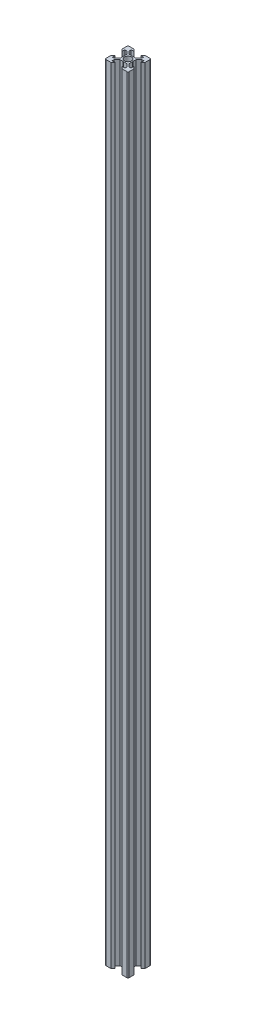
ISO-10303-21;
HEADER;
FILE_DESCRIPTION(('STEP AP214'),'2;1');
FILE_NAME('part.step','',(''),(''),'','','');
FILE_SCHEMA(('AUTOMOTIVE_DESIGN { 1 0 10303 214 1 1 1 1 }'));
ENDSEC;
DATA;
#1=APPLICATION_CONTEXT('core data for automotive mechanical design processes');
#2=APPLICATION_PROTOCOL_DEFINITION('international standard','automotive_design',2000,#1);
#3=PRODUCT_CONTEXT('',#1,'mechanical');
#4=PRODUCT('Part','Part','',(#3));
#5=PRODUCT_RELATED_PRODUCT_CATEGORY('part','',(#4));
#6=PRODUCT_DEFINITION_FORMATION('','',#4);
#7=PRODUCT_DEFINITION_CONTEXT('part definition',#1,'design');
#8=PRODUCT_DEFINITION('design','',#6,#7);
#9=PRODUCT_DEFINITION_SHAPE('','',#8);
#10=(LENGTH_UNIT() NAMED_UNIT(*) SI_UNIT(.MILLI.,.METRE.));
#11=(NAMED_UNIT(*) PLANE_ANGLE_UNIT() SI_UNIT($,.RADIAN.));
#12=(NAMED_UNIT(*) SI_UNIT($,.STERADIAN.) SOLID_ANGLE_UNIT());
#13=UNCERTAINTY_MEASURE_WITH_UNIT(LENGTH_MEASURE(1.E-05),#10,'distance_accuracy_value','');
#14=(GEOMETRIC_REPRESENTATION_CONTEXT(3) GLOBAL_UNCERTAINTY_ASSIGNED_CONTEXT((#13)) GLOBAL_UNIT_ASSIGNED_CONTEXT((#10,
#11,#12)) REPRESENTATION_CONTEXT('',''));
#15=CARTESIAN_POINT('',(0.,0.,0.));
#16=DIRECTION('',(0.,0.,1.));
#17=DIRECTION('',(1.,0.,0.));
#18=AXIS2_PLACEMENT_3D('',#15,#16,#17);
#19=CARTESIAN_POINT('',(8.99964000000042,680.,8.99963999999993));
#20=DIRECTION('',(0.,1.,0.));
#21=DIRECTION('',(0.,0.,1.));
#22=AXIS2_PLACEMENT_3D('',#19,#20,#21);
#23=PLANE('',#22);
#24=CARTESIAN_POINT('',(8.99964000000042,680.,8.99963999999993));
#25=DIRECTION('',(0.,1.,0.));
#26=DIRECTION('',(0.,0.,1.));
#27=AXIS2_PLACEMENT_3D('',#24,#25,#26);
#28=CIRCLE('',#27,0.99996);
#29=CARTESIAN_POINT('',(8.99964000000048,680.,9.99959999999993));
#30=VERTEX_POINT('',#29);
#31=CARTESIAN_POINT('',(9.99960000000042,680.,8.99963999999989));
#32=VERTEX_POINT('',#31);
#33=EDGE_CURVE('E640',#30,#32,#28,.T.);
#34=ORIENTED_EDGE('',*,*,#33,.T.);
#35=DIRECTION('',(0.,0.,-1.));
#36=VECTOR('',#35,1.);
#37=CARTESIAN_POINT('',(9.99960000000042,680.,8.99963999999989));
#38=LINE('',#37,#36);
#39=CARTESIAN_POINT('',(9.99960000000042,680.,4.79980799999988));
#40=VERTEX_POINT('',#39);
#41=EDGE_CURVE('E264',#32,#40,#38,.T.);
#42=ORIENTED_EDGE('',*,*,#41,.T.);
#43=DIRECTION('',(-0.707106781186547,0.,-0.707106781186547));
#44=VECTOR('',#43,1.);
#45=CARTESIAN_POINT('',(9.99960000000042,680.,4.79980799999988));
#46=LINE('',#45,#44);
#47=CARTESIAN_POINT('',(8.19967200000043,680.,2.99987999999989));
#48=VERTEX_POINT('',#47);
#49=EDGE_CURVE('E869',#40,#48,#46,.T.);
#50=ORIENTED_EDGE('',*,*,#49,.T.);
#51=DIRECTION('',(0.,0.,1.));
#52=VECTOR('',#51,1.);
#53=CARTESIAN_POINT('',(8.19967200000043,680.,2.99987999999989));
#54=LINE('',#53,#52);
#55=CARTESIAN_POINT('',(8.19967200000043,680.,5.49977999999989));
#56=VERTEX_POINT('',#55);
#57=EDGE_CURVE('E889',#48,#56,#54,.T.);
#58=ORIENTED_EDGE('',*,*,#57,.T.);
#59=DIRECTION('',(-1.,0.,0.));
#60=VECTOR('',#59,1.);
#61=CARTESIAN_POINT('',(8.19967200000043,680.,5.49977999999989));
#62=LINE('',#61,#60);
#63=CARTESIAN_POINT('',(6.56039774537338,680.,5.49977999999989));
#64=VERTEX_POINT('',#63);
#65=EDGE_CURVE('E885',#56,#64,#62,.T.);
#66=ORIENTED_EDGE('',*,*,#65,.T.);
#67=DIRECTION('',(-0.707106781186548,0.,-0.707106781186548));
#68=VECTOR('',#67,1.);
#69=CARTESIAN_POINT('',(6.56039774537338,680.,5.49977999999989));
#70=LINE('',#69,#68);
#71=CARTESIAN_POINT('',(3.99984000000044,680.,2.93922225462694));
#72=VERTEX_POINT('',#71);
#73=EDGE_CURVE('E888',#64,#72,#70,.T.);
#74=ORIENTED_EDGE('',*,*,#73,.T.);
#75=DIRECTION('',(0.,0.,-1.));
#76=VECTOR('',#75,1.);
#77=CARTESIAN_POINT('',(3.99984000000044,680.,2.93922225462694));
#78=LINE('',#77,#76);
#79=CARTESIAN_POINT('',(3.99984000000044,680.,0.299987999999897));
#80=VERTEX_POINT('',#79);
#81=EDGE_CURVE('E893',#72,#80,#78,.T.);
#82=ORIENTED_EDGE('',*,*,#81,.T.);
#83=DIRECTION('',(-0.707106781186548,0.,-0.707106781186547));
#84=VECTOR('',#83,1.);
#85=CARTESIAN_POINT('',(3.99984000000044,680.,0.299987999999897));
#86=LINE('',#85,#84);
#87=CARTESIAN_POINT('',(3.69985200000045,680.,0.));
#88=VERTEX_POINT('',#87);
#89=EDGE_CURVE('E900',#80,#88,#86,.T.);
#90=ORIENTED_EDGE('',*,*,#89,.T.);
#91=DIRECTION('',(0.707106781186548,0.,-0.707106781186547));
#92=VECTOR('',#91,1.);
#93=CARTESIAN_POINT('',(3.69985200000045,680.,0.));
#94=LINE('',#93,#92);
#95=CARTESIAN_POINT('',(3.99984000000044,680.,-0.299988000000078));
#96=VERTEX_POINT('',#95);
#97=EDGE_CURVE('E903',#88,#96,#94,.T.);
#98=ORIENTED_EDGE('',*,*,#97,.T.);
#99=DIRECTION('',(0.,0.,-1.));
#100=VECTOR('',#99,1.);
#101=CARTESIAN_POINT('',(3.99984000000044,680.,-0.299988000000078));
#102=LINE('',#101,#100);
#103=CARTESIAN_POINT('',(3.99984000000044,680.,-2.93922225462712));
#104=VERTEX_POINT('',#103);
#105=EDGE_CURVE('E906',#96,#104,#102,.T.);
#106=ORIENTED_EDGE('',*,*,#105,.T.);
#107=DIRECTION('',(0.707106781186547,0.,-0.707106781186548));
#108=VECTOR('',#107,1.);
#109=CARTESIAN_POINT('',(3.99984000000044,680.,-2.93922225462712));
#110=LINE('',#109,#108);
#111=CARTESIAN_POINT('',(6.56039774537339,680.,-5.49978000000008));
#112=VERTEX_POINT('',#111);
#113=EDGE_CURVE('E909',#104,#112,#110,.T.);
#114=ORIENTED_EDGE('',*,*,#113,.T.);
#115=DIRECTION('',(1.,0.,0.));
#116=VECTOR('',#115,1.);
#117=CARTESIAN_POINT('',(6.56039774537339,680.,-5.49978000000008));
#118=LINE('',#117,#116);
#119=CARTESIAN_POINT('',(8.1996720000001,680.,-5.49978000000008));
#120=VERTEX_POINT('',#119);
#121=EDGE_CURVE('E912',#112,#120,#118,.T.);
#122=ORIENTED_EDGE('',*,*,#121,.T.);
#123=DIRECTION('',(0.,0.,1.));
#124=VECTOR('',#123,1.);
#125=CARTESIAN_POINT('',(8.1996720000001,680.,-5.49978000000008));
#126=LINE('',#125,#124);
#127=CARTESIAN_POINT('',(8.1996720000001,680.,-2.99987999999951));
#128=VERTEX_POINT('',#127);
#129=EDGE_CURVE('E915',#120,#128,#126,.T.);
#130=ORIENTED_EDGE('',*,*,#129,.T.);
#131=DIRECTION('',(0.707106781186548,0.,-0.707106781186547));
#132=VECTOR('',#131,1.);
#133=CARTESIAN_POINT('',(8.1996720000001,680.,-2.99987999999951));
#134=LINE('',#133,#132);
#135=CARTESIAN_POINT('',(9.99960000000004,680.,-4.79980799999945));
#136=VERTEX_POINT('',#135);
#137=EDGE_CURVE('E918',#128,#136,#134,.T.);
#138=ORIENTED_EDGE('',*,*,#137,.T.);
#139=DIRECTION('',(0.,0.,-1.));
#140=VECTOR('',#139,1.);
#141=CARTESIAN_POINT('',(9.99960000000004,680.,-4.79980799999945));
#142=LINE('',#141,#140);
#143=CARTESIAN_POINT('',(9.99960000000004,680.,-8.99963999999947));
#144=VERTEX_POINT('',#143);
#145=EDGE_CURVE('E921',#136,#144,#142,.T.);
#146=ORIENTED_EDGE('',*,*,#145,.T.);
#147=CARTESIAN_POINT('',(8.99964000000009,680.,-8.9996399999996));
#148=DIRECTION('',(0.,1.,0.));
#149=DIRECTION('',(0.,0.,1.));
#150=AXIS2_PLACEMENT_3D('',#147,#148,#149);
#151=CIRCLE('',#150,0.999959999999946);
#152=CARTESIAN_POINT('',(8.99964000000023,680.,-9.99959999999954));
#153=VERTEX_POINT('',#152);
#154=EDGE_CURVE('E924',#144,#153,#151,.T.);
#155=ORIENTED_EDGE('',*,*,#154,.T.);
#156=DIRECTION('',(-1.,0.,0.));
#157=VECTOR('',#156,1.);
#158=CARTESIAN_POINT('',(8.99964000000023,680.,-9.99959999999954));
#159=LINE('',#158,#157);
#160=CARTESIAN_POINT('',(4.79980800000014,680.,-9.99959999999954));
#161=VERTEX_POINT('',#160);
#162=EDGE_CURVE('E927',#153,#161,#159,.T.);
#163=ORIENTED_EDGE('',*,*,#162,.T.);
#164=DIRECTION('',(-0.707106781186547,0.,0.707106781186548));
#165=VECTOR('',#164,1.);
#166=CARTESIAN_POINT('',(4.79980800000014,680.,-9.99959999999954));
#167=LINE('',#166,#165);
#168=CARTESIAN_POINT('',(2.99988000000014,680.,-8.19967199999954));
#169=VERTEX_POINT('',#168);
#170=EDGE_CURVE('E930',#161,#169,#167,.T.);
#171=ORIENTED_EDGE('',*,*,#170,.T.);
#172=DIRECTION('',(1.,0.,0.));
#173=VECTOR('',#172,1.);
#174=CARTESIAN_POINT('',(2.99988000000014,680.,-8.19967199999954));
#175=LINE('',#174,#173);
#176=CARTESIAN_POINT('',(5.49978000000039,680.,-8.19967199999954));
#177=VERTEX_POINT('',#176);
#178=EDGE_CURVE('E933',#169,#177,#175,.T.);
#179=ORIENTED_EDGE('',*,*,#178,.T.);
#180=DIRECTION('',(0.,0.,1.));
#181=VECTOR('',#180,1.);
#182=CARTESIAN_POINT('',(5.49978000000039,680.,-8.19967199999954));
#183=LINE('',#182,#181);
#184=CARTESIAN_POINT('',(5.49978000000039,680.,-6.56039774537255));
#185=VERTEX_POINT('',#184);
#186=EDGE_CURVE('E936',#177,#185,#183,.T.);
#187=ORIENTED_EDGE('',*,*,#186,.T.);
#188=DIRECTION('',(-0.707106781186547,0.,0.707106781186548));
#189=VECTOR('',#188,1.);
#190=CARTESIAN_POINT('',(5.49978000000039,680.,-6.56039774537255));
#191=LINE('',#190,#189);
#192=CARTESIAN_POINT('',(2.93922225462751,680.,-3.99983999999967));
#193=VERTEX_POINT('',#192);
#194=EDGE_CURVE('E939',#185,#193,#191,.T.);
#195=ORIENTED_EDGE('',*,*,#194,.T.);
#196=DIRECTION('',(-1.,0.,0.));
#197=VECTOR('',#196,1.);
#198=CARTESIAN_POINT('',(2.93922225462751,680.,-3.99983999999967));
#199=LINE('',#198,#197);
#200=CARTESIAN_POINT('',(0.299988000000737,680.,-3.99983999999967));
#201=VERTEX_POINT('',#200);
#202=EDGE_CURVE('E942',#193,#201,#199,.T.);
#203=ORIENTED_EDGE('',*,*,#202,.T.);
#204=DIRECTION('',(-0.707106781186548,0.,0.707106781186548));
#205=VECTOR('',#204,1.);
#206=CARTESIAN_POINT('',(0.299988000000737,680.,-3.99983999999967));
#207=LINE('',#206,#205);
#208=CARTESIAN_POINT('',(7.49352141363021E-13,680.,-3.69985199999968));
#209=VERTEX_POINT('',#208);
#210=EDGE_CURVE('E945',#201,#209,#207,.T.);
#211=ORIENTED_EDGE('',*,*,#210,.T.);
#212=DIRECTION('',(-0.707106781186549,0.,-0.707106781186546));
#213=VECTOR('',#212,1.);
#214=CARTESIAN_POINT('',(7.49352141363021E-13,680.,-3.69985199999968));
#215=LINE('',#214,#213);
#216=CARTESIAN_POINT('',(-0.299987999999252,680.,-3.99983999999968));
#217=VERTEX_POINT('',#216);
#218=EDGE_CURVE('E948',#209,#217,#215,.T.);
#219=ORIENTED_EDGE('',*,*,#218,.T.);
#220=DIRECTION('',(-1.,0.,0.));
#221=VECTOR('',#220,1.);
#222=CARTESIAN_POINT('',(-0.299987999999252,680.,-3.99983999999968));
#223=LINE('',#222,#221);
#224=CARTESIAN_POINT('',(-2.9392222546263,680.,-3.99983999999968));
#225=VERTEX_POINT('',#224);
#226=EDGE_CURVE('E951',#217,#225,#223,.T.);
#227=ORIENTED_EDGE('',*,*,#226,.T.);
#228=DIRECTION('',(-0.707106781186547,0.,-0.707106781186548));
#229=VECTOR('',#228,1.);
#230=CARTESIAN_POINT('',(-2.9392222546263,680.,-3.99983999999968));
#231=LINE('',#230,#229);
#232=CARTESIAN_POINT('',(-5.49977999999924,680.,-6.56039774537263));
#233=VERTEX_POINT('',#232);
#234=EDGE_CURVE('E954',#225,#233,#231,.T.);
#235=ORIENTED_EDGE('',*,*,#234,.T.);
#236=DIRECTION('',(0.,0.,-1.));
#237=VECTOR('',#236,1.);
#238=CARTESIAN_POINT('',(-5.49977999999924,680.,-6.56039774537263));
#239=LINE('',#238,#237);
#240=CARTESIAN_POINT('',(-5.49977999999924,680.,-8.19967200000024));
#241=VERTEX_POINT('',#240);
#242=EDGE_CURVE('E957',#233,#241,#239,.T.);
#243=ORIENTED_EDGE('',*,*,#242,.T.);
#244=DIRECTION('',(1.,0.,0.));
#245=VECTOR('',#244,1.);
#246=CARTESIAN_POINT('',(-5.49977999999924,680.,-8.19967200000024));
#247=LINE('',#246,#245);
#248=CARTESIAN_POINT('',(-2.99988000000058,680.,-8.19967200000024));
#249=VERTEX_POINT('',#248);
#250=EDGE_CURVE('E960',#241,#249,#247,.T.);
#251=ORIENTED_EDGE('',*,*,#250,.T.);
#252=DIRECTION('',(-0.707106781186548,0.,-0.707106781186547));
#253=VECTOR('',#252,1.);
#254=CARTESIAN_POINT('',(-2.99988000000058,680.,-8.19967200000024));
#255=LINE('',#254,#253);
#256=CARTESIAN_POINT('',(-4.79980800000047,680.,-9.99960000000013));
#257=VERTEX_POINT('',#256);
#258=EDGE_CURVE('E963',#249,#257,#255,.T.);
#259=ORIENTED_EDGE('',*,*,#258,.T.);
#260=DIRECTION('',(-1.,0.,0.));
#261=VECTOR('',#260,1.);
#262=CARTESIAN_POINT('',(-4.79980800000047,680.,-9.99960000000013));
#263=LINE('',#262,#261);
#264=CARTESIAN_POINT('',(-8.99963999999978,680.,-9.99960000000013));
#265=VERTEX_POINT('',#264);
#266=EDGE_CURVE('E966',#257,#265,#263,.T.);
#267=ORIENTED_EDGE('',*,*,#266,.T.);
#268=CARTESIAN_POINT('',(-8.99963999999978,680.,-8.99964000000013));
#269=DIRECTION('',(0.,1.,0.));
#270=DIRECTION('',(0.,0.,1.));
#271=AXIS2_PLACEMENT_3D('',#268,#269,#270);
#272=CIRCLE('',#271,0.999959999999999);
#273=CARTESIAN_POINT('',(-9.99959999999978,680.,-8.99964000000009));
#274=VERTEX_POINT('',#273);
#275=EDGE_CURVE('E969',#265,#274,#272,.T.);
#276=ORIENTED_EDGE('',*,*,#275,.T.);
#277=DIRECTION('',(0.,0.,1.));
#278=VECTOR('',#277,1.);
#279=CARTESIAN_POINT('',(-9.99959999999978,680.,-8.99964000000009));
#280=LINE('',#279,#278);
#281=CARTESIAN_POINT('',(-9.99959999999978,680.,-4.79980800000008));
#282=VERTEX_POINT('',#281);
#283=EDGE_CURVE('E972',#274,#282,#280,.T.);
#284=ORIENTED_EDGE('',*,*,#283,.T.);
#285=DIRECTION('',(0.707106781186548,0.,0.707106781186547));
#286=VECTOR('',#285,1.);
#287=CARTESIAN_POINT('',(-9.99959999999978,680.,-4.79980800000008));
#288=LINE('',#287,#286);
#289=CARTESIAN_POINT('',(-8.19967199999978,680.,-2.99988000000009));
#290=VERTEX_POINT('',#289);
#291=EDGE_CURVE('E975',#282,#290,#288,.T.);
#292=ORIENTED_EDGE('',*,*,#291,.T.);
#293=DIRECTION('',(0.,0.,-1.));
#294=VECTOR('',#293,1.);
#295=CARTESIAN_POINT('',(-8.19967199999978,680.,-2.99988000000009));
#296=LINE('',#295,#294);
#297=CARTESIAN_POINT('',(-8.19967199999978,680.,-5.49978000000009));
#298=VERTEX_POINT('',#297);
#299=EDGE_CURVE('E978',#290,#298,#296,.T.);
#300=ORIENTED_EDGE('',*,*,#299,.T.);
#301=DIRECTION('',(1.,0.,0.));
#302=VECTOR('',#301,1.);
#303=CARTESIAN_POINT('',(-8.19967199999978,680.,-5.49978000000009));
#304=LINE('',#303,#302);
#305=CARTESIAN_POINT('',(-6.56039774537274,680.,-5.49978000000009));
#306=VERTEX_POINT('',#305);
#307=EDGE_CURVE('E981',#298,#306,#304,.T.);
#308=ORIENTED_EDGE('',*,*,#307,.T.);
#309=DIRECTION('',(0.707106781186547,0.,0.707106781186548));
#310=VECTOR('',#309,1.);
#311=CARTESIAN_POINT('',(-6.56039774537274,680.,-5.49978000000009));
#312=LINE('',#311,#310);
#313=CARTESIAN_POINT('',(-3.9998399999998,680.,-2.93922225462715));
#314=VERTEX_POINT('',#313);
#315=EDGE_CURVE('E984',#306,#314,#312,.T.);
#316=ORIENTED_EDGE('',*,*,#315,.T.);
#317=DIRECTION('',(0.,0.,1.));
#318=VECTOR('',#317,1.);
#319=CARTESIAN_POINT('',(-3.9998399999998,680.,-2.93922225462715));
#320=LINE('',#319,#318);
#321=CARTESIAN_POINT('',(-3.9998399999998,680.,-0.299988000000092));
#322=VERTEX_POINT('',#321);
#323=EDGE_CURVE('E987',#314,#322,#320,.T.);
#324=ORIENTED_EDGE('',*,*,#323,.T.);
#325=DIRECTION('',(0.707106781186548,0.,0.707106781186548));
#326=VECTOR('',#325,1.);
#327=CARTESIAN_POINT('',(-3.9998399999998,680.,-0.299988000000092));
#328=LINE('',#327,#326);
#329=CARTESIAN_POINT('',(-3.69985199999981,680.,-1.04081468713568E-13));
#330=VERTEX_POINT('',#329);
#331=EDGE_CURVE('E990',#322,#330,#328,.T.);
#332=ORIENTED_EDGE('',*,*,#331,.T.);
#333=DIRECTION('',(-0.707106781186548,0.,0.707106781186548));
#334=VECTOR('',#333,1.);
#335=CARTESIAN_POINT('',(-3.69985199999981,680.,-1.04081468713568E-13));
#336=LINE('',#335,#334);
#337=CARTESIAN_POINT('',(-3.9998399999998,680.,0.299987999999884));
#338=VERTEX_POINT('',#337);
#339=EDGE_CURVE('E993',#330,#338,#336,.T.);
#340=ORIENTED_EDGE('',*,*,#339,.T.);
#341=DIRECTION('',(0.,0.,1.));
#342=VECTOR('',#341,1.);
#343=CARTESIAN_POINT('',(-3.9998399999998,680.,0.299987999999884));
#344=LINE('',#343,#342);
#345=CARTESIAN_POINT('',(-3.99983999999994,680.,2.93922225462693));
#346=VERTEX_POINT('',#345);
#347=EDGE_CURVE('E996',#338,#346,#344,.T.);
#348=ORIENTED_EDGE('',*,*,#347,.T.);
#349=DIRECTION('',(-0.707106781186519,0.,0.707106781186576));
#350=VECTOR('',#349,1.);
#351=CARTESIAN_POINT('',(-3.99983999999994,680.,2.93922225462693));
#352=LINE('',#351,#350);
#353=CARTESIAN_POINT('',(-6.56039774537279,680.,5.49977999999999));
#354=VERTEX_POINT('',#353);
#355=EDGE_CURVE('E999',#346,#354,#352,.T.);
#356=ORIENTED_EDGE('',*,*,#355,.T.);
#357=DIRECTION('',(-1.,0.,0.));
#358=VECTOR('',#357,1.);
#359=CARTESIAN_POINT('',(-6.56039774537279,680.,5.49977999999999));
#360=LINE('',#359,#358);
#361=CARTESIAN_POINT('',(-8.19967199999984,680.,5.49978000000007));
#362=VERTEX_POINT('',#361);
#363=EDGE_CURVE('E1002',#354,#362,#360,.T.);
#364=ORIENTED_EDGE('',*,*,#363,.T.);
#365=DIRECTION('',(0.,0.,-1.));
#366=VECTOR('',#365,1.);
#367=CARTESIAN_POINT('',(-8.19967199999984,680.,5.49978000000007));
#368=LINE('',#367,#366);
#369=CARTESIAN_POINT('',(-8.19967199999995,680.,2.99988000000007));
#370=VERTEX_POINT('',#369);
#371=EDGE_CURVE('E1005',#362,#370,#368,.T.);
#372=ORIENTED_EDGE('',*,*,#371,.T.);
#373=DIRECTION('',(-0.707106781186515,0.,0.70710678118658));
#374=VECTOR('',#373,1.);
#375=CARTESIAN_POINT('',(-8.19967199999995,680.,2.99988000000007));
#376=LINE('',#375,#374);
#377=CARTESIAN_POINT('',(-9.99959999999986,680.,4.79980800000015));
#378=VERTEX_POINT('',#377);
#379=EDGE_CURVE('E1008',#370,#378,#376,.T.);
#380=ORIENTED_EDGE('',*,*,#379,.T.);
#381=DIRECTION('',(0.,0.,1.));
#382=VECTOR('',#381,1.);
#383=CARTESIAN_POINT('',(-9.99959999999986,680.,4.79980800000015));
#384=LINE('',#383,#382);
#385=CARTESIAN_POINT('',(-9.99959999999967,680.,8.99964000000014));
#386=VERTEX_POINT('',#385);
#387=EDGE_CURVE('E1011',#378,#386,#384,.T.);
#388=ORIENTED_EDGE('',*,*,#387,.T.);
#389=CARTESIAN_POINT('',(-8.99963999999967,680.,8.9996400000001));
#390=DIRECTION('',(0.,1.,0.));
#391=DIRECTION('',(0.,0.,1.));
#392=AXIS2_PLACEMENT_3D('',#389,#390,#391);
#393=CIRCLE('',#392,0.99996);
#394=CARTESIAN_POINT('',(-8.99963999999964,680.,9.9996000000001));
#395=VERTEX_POINT('',#394);
#396=EDGE_CURVE('E1014',#386,#395,#393,.T.);
#397=ORIENTED_EDGE('',*,*,#396,.T.);
#398=DIRECTION('',(1.,0.,0.));
#399=VECTOR('',#398,1.);
#400=CARTESIAN_POINT('',(-8.99963999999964,680.,9.9996000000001));
#401=LINE('',#400,#399);
#402=CARTESIAN_POINT('',(-4.79980799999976,680.,9.9996000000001));
#403=VERTEX_POINT('',#402);
#404=EDGE_CURVE('E1017',#395,#403,#401,.T.);
#405=ORIENTED_EDGE('',*,*,#404,.T.);
#406=DIRECTION('',(0.707106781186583,0.,-0.707106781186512));
#407=VECTOR('',#406,1.);
#408=CARTESIAN_POINT('',(-4.79980799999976,680.,9.9996000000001));
#409=LINE('',#408,#407);
#410=CARTESIAN_POINT('',(-2.99987999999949,680.,8.19967200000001));
#411=VERTEX_POINT('',#410);
#412=EDGE_CURVE('E1020',#403,#411,#409,.T.);
#413=ORIENTED_EDGE('',*,*,#412,.T.);
#414=DIRECTION('',(-1.,0.,0.));
#415=VECTOR('',#414,1.);
#416=CARTESIAN_POINT('',(-2.99987999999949,680.,8.19967200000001));
#417=LINE('',#416,#415);
#418=CARTESIAN_POINT('',(-5.49977999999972,680.,8.19967199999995));
#419=VERTEX_POINT('',#418);
#420=EDGE_CURVE('E1023',#411,#419,#417,.T.);
#421=ORIENTED_EDGE('',*,*,#420,.T.);
#422=DIRECTION('',(0.,0.,-1.));
#423=VECTOR('',#422,1.);
#424=CARTESIAN_POINT('',(-5.49977999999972,680.,8.19967199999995));
#425=LINE('',#424,#423);
#426=CARTESIAN_POINT('',(-5.49977999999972,680.,6.56039774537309));
#427=VERTEX_POINT('',#426);
#428=EDGE_CURVE('E1026',#419,#427,#425,.T.);
#429=ORIENTED_EDGE('',*,*,#428,.T.);
#430=DIRECTION('',(0.707106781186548,0.,-0.707106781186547));
#431=VECTOR('',#430,1.);
#432=CARTESIAN_POINT('',(-5.49977999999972,680.,6.56039774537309));
#433=LINE('',#432,#431);
#434=CARTESIAN_POINT('',(-2.93922225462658,680.,3.99983999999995));
#435=VERTEX_POINT('',#434);
#436=EDGE_CURVE('E1029',#427,#435,#433,.T.);
#437=ORIENTED_EDGE('',*,*,#436,.T.);
#438=DIRECTION('',(1.,0.,0.));
#439=VECTOR('',#438,1.);
#440=CARTESIAN_POINT('',(-2.93922225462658,680.,3.99983999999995));
#441=LINE('',#440,#439);
#442=CARTESIAN_POINT('',(-0.299987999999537,680.,3.99983999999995));
#443=VERTEX_POINT('',#442);
#444=EDGE_CURVE('E1032',#435,#443,#441,.T.);
#445=ORIENTED_EDGE('',*,*,#444,.T.);
#446=DIRECTION('',(0.707106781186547,0.,-0.707106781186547));
#447=VECTOR('',#446,1.);
#448=CARTESIAN_POINT('',(-0.299987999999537,680.,3.99983999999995));
#449=LINE('',#448,#447);
#450=CARTESIAN_POINT('',(4.57894783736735E-13,680.,3.69985199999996));
#451=VERTEX_POINT('',#450);
#452=EDGE_CURVE('E1035',#443,#451,#449,.T.);
#453=ORIENTED_EDGE('',*,*,#452,.T.);
#454=DIRECTION('',(0.707106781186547,0.,0.707106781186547));
#455=VECTOR('',#454,1.);
#456=CARTESIAN_POINT('',(4.57894783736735E-13,680.,3.69985199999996));
#457=LINE('',#456,#455);
#458=CARTESIAN_POINT('',(0.299988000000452,680.,3.99983999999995));
#459=VERTEX_POINT('',#458);
#460=EDGE_CURVE('E1038',#451,#459,#457,.T.);
#461=ORIENTED_EDGE('',*,*,#460,.T.);
#462=DIRECTION('',(1.,0.,0.));
#463=VECTOR('',#462,1.);
#464=CARTESIAN_POINT('',(0.299988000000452,680.,3.99983999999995));
#465=LINE('',#464,#463);
#466=CARTESIAN_POINT('',(2.93922225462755,680.,3.99983999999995));
#467=VERTEX_POINT('',#466);
#468=EDGE_CURVE('E1041',#459,#467,#465,.T.);
#469=ORIENTED_EDGE('',*,*,#468,.T.);
#470=DIRECTION('',(0.707106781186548,0.,0.707106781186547));
#471=VECTOR('',#470,1.);
#472=CARTESIAN_POINT('',(2.93922225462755,680.,3.99983999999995));
#473=LINE('',#472,#471);
#474=CARTESIAN_POINT('',(5.49978000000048,680.,6.56039774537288));
#475=VERTEX_POINT('',#474);
#476=EDGE_CURVE('E1044',#467,#475,#473,.T.);
#477=ORIENTED_EDGE('',*,*,#476,.T.);
#478=DIRECTION('',(0.,0.,1.));
#479=VECTOR('',#478,1.);
#480=CARTESIAN_POINT('',(5.49978000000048,680.,6.56039774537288));
#481=LINE('',#480,#479);
#482=CARTESIAN_POINT('',(5.49978000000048,680.,8.19967199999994));
#483=VERTEX_POINT('',#482);
#484=EDGE_CURVE('E439',#475,#483,#481,.T.);
#485=ORIENTED_EDGE('',*,*,#484,.T.);
#486=DIRECTION('',(-1.,0.,0.));
#487=VECTOR('',#486,1.);
#488=CARTESIAN_POINT('',(5.49978000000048,680.,8.19967199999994));
#489=LINE('',#488,#487);
#490=CARTESIAN_POINT('',(2.99988000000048,680.,8.19967199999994));
#491=VERTEX_POINT('',#490);
#492=EDGE_CURVE('E433',#483,#491,#489,.T.);
#493=ORIENTED_EDGE('',*,*,#492,.T.);
#494=DIRECTION('',(0.707106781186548,0.,0.707106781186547));
#495=VECTOR('',#494,1.);
#496=CARTESIAN_POINT('',(2.99988000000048,680.,8.19967199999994));
#497=LINE('',#496,#495);
#498=CARTESIAN_POINT('',(4.79980800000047,680.,9.99959999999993));
#499=VERTEX_POINT('',#498);
#500=EDGE_CURVE('E437',#491,#499,#497,.T.);
#501=ORIENTED_EDGE('',*,*,#500,.T.);
#502=DIRECTION('',(1.,0.,0.));
#503=VECTOR('',#502,1.);
#504=CARTESIAN_POINT('',(4.79980800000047,680.,9.99959999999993));
#505=LINE('',#504,#503);
#506=EDGE_CURVE('E65',#499,#30,#505,.T.);
#507=ORIENTED_EDGE('',*,*,#506,.T.);
#508=EDGE_LOOP('',(#34,#42,#50,#58,#66,#74,#82,#90,#98,#106,#114,#122,#130,#138,#146,#155,#163,
#171,#179,#187,#195,#203,#211,#219,#227,#235,#243,#251,#259,#267,#276,#284,#292,#300,#308,#316,
#324,#332,#340,#348,#356,#364,#372,#380,#388,#397,#405,#413,#421,#429,#437,#445,#453,#461,#469,
#477,#485,#493,#501,#507));
#509=FACE_BOUND('',#508,.T.);
#510=CARTESIAN_POINT('',(0.,680.,0.));
#511=DIRECTION('',(0.,1.,0.));
#512=DIRECTION('',(0.,0.,1.));
#513=AXIS2_PLACEMENT_3D('',#510,#511,#512);
#514=CIRCLE('',#513,3.);
#515=CARTESIAN_POINT('',(0.,680.,3.));
#516=VERTEX_POINT('',#515);
#517=EDGE_CURVE('E466',#516,#516,#514,.T.);
#518=ORIENTED_EDGE('',*,*,#517,.F.);
#519=EDGE_LOOP('',(#518));
#520=FACE_BOUND('',#519,.T.);
#521=ADVANCED_FACE('F47',(#509,#520),#23,.T.);
#522=CARTESIAN_POINT('',(8.99964000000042,0.,8.99963999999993));
#523=DIRECTION('',(0.,1.,0.));
#524=DIRECTION('',(0.,0.,1.));
#525=AXIS2_PLACEMENT_3D('',#522,#523,#524);
#526=PLANE('',#525);
#527=CARTESIAN_POINT('',(8.99964000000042,0.,8.99963999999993));
#528=DIRECTION('',(0.,1.,0.));
#529=DIRECTION('',(0.,0.,1.));
#530=AXIS2_PLACEMENT_3D('',#527,#528,#529);
#531=CIRCLE('',#530,0.99996);
#532=CARTESIAN_POINT('',(8.99964000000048,0.,9.99959999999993));
#533=VERTEX_POINT('',#532);
#534=CARTESIAN_POINT('',(9.99960000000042,0.,8.99963999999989));
#535=VERTEX_POINT('',#534);
#536=EDGE_CURVE('E461',#533,#535,#531,.T.);
#537=ORIENTED_EDGE('',*,*,#536,.F.);
#538=DIRECTION('',(1.,0.,0.));
#539=VECTOR('',#538,1.);
#540=CARTESIAN_POINT('',(4.79980800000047,0.,9.99959999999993));
#541=LINE('',#540,#539);
#542=CARTESIAN_POINT('',(4.79980800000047,0.,9.99959999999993));
#543=VERTEX_POINT('',#542);
#544=EDGE_CURVE('E256',#543,#533,#541,.T.);
#545=ORIENTED_EDGE('',*,*,#544,.F.);
#546=DIRECTION('',(0.707106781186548,0.,0.707106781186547));
#547=VECTOR('',#546,1.);
#548=CARTESIAN_POINT('',(2.99988000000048,0.,8.19967199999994));
#549=LINE('',#548,#547);
#550=CARTESIAN_POINT('',(2.99988000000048,0.,8.19967199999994));
#551=VERTEX_POINT('',#550);
#552=EDGE_CURVE('E250',#551,#543,#549,.T.);
#553=ORIENTED_EDGE('',*,*,#552,.F.);
#554=DIRECTION('',(-1.,0.,0.));
#555=VECTOR('',#554,1.);
#556=CARTESIAN_POINT('',(5.49978000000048,0.,8.19967199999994));
#557=LINE('',#556,#555);
#558=CARTESIAN_POINT('',(5.49978000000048,0.,8.19967199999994));
#559=VERTEX_POINT('',#558);
#560=EDGE_CURVE('E448',#559,#551,#557,.T.);
#561=ORIENTED_EDGE('',*,*,#560,.F.);
#562=DIRECTION('',(0.,0.,1.));
#563=VECTOR('',#562,1.);
#564=CARTESIAN_POINT('',(5.49978000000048,0.,6.56039774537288));
#565=LINE('',#564,#563);
#566=CARTESIAN_POINT('',(5.49978000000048,0.,6.56039774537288));
#567=VERTEX_POINT('',#566);
#568=EDGE_CURVE('E631',#567,#559,#565,.T.);
#569=ORIENTED_EDGE('',*,*,#568,.F.);
#570=DIRECTION('',(0.707106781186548,0.,0.707106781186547));
#571=VECTOR('',#570,1.);
#572=CARTESIAN_POINT('',(2.93922225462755,0.,3.99983999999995));
#573=LINE('',#572,#571);
#574=CARTESIAN_POINT('',(2.93922225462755,0.,3.99983999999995));
#575=VERTEX_POINT('',#574);
#576=EDGE_CURVE('E628',#575,#567,#573,.T.);
#577=ORIENTED_EDGE('',*,*,#576,.F.);
#578=DIRECTION('',(1.,0.,0.));
#579=VECTOR('',#578,1.);
#580=CARTESIAN_POINT('',(0.299988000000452,0.,3.99983999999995));
#581=LINE('',#580,#579);
#582=CARTESIAN_POINT('',(0.299988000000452,0.,3.99983999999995));
#583=VERTEX_POINT('',#582);
#584=EDGE_CURVE('E625',#583,#575,#581,.T.);
#585=ORIENTED_EDGE('',*,*,#584,.F.);
#586=DIRECTION('',(0.707106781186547,0.,0.707106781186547));
#587=VECTOR('',#586,1.);
#588=CARTESIAN_POINT('',(4.57894783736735E-13,0.,3.69985199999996));
#589=LINE('',#588,#587);
#590=CARTESIAN_POINT('',(4.57894783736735E-13,0.,3.69985199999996));
#591=VERTEX_POINT('',#590);
#592=EDGE_CURVE('E622',#591,#583,#589,.T.);
#593=ORIENTED_EDGE('',*,*,#592,.F.);
#594=DIRECTION('',(0.707106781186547,0.,-0.707106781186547));
#595=VECTOR('',#594,1.);
#596=CARTESIAN_POINT('',(-0.299987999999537,0.,3.99983999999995));
#597=LINE('',#596,#595);
#598=CARTESIAN_POINT('',(-0.299987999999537,0.,3.99983999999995));
#599=VERTEX_POINT('',#598);
#600=EDGE_CURVE('E619',#599,#591,#597,.T.);
#601=ORIENTED_EDGE('',*,*,#600,.F.);
#602=DIRECTION('',(1.,0.,0.));
#603=VECTOR('',#602,1.);
#604=CARTESIAN_POINT('',(-2.93922225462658,0.,3.99983999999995));
#605=LINE('',#604,#603);
#606=CARTESIAN_POINT('',(-2.93922225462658,0.,3.99983999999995));
#607=VERTEX_POINT('',#606);
#608=EDGE_CURVE('E616',#607,#599,#605,.T.);
#609=ORIENTED_EDGE('',*,*,#608,.F.);
#610=DIRECTION('',(0.707106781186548,0.,-0.707106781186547));
#611=VECTOR('',#610,1.);
#612=CARTESIAN_POINT('',(-5.49977999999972,0.,6.56039774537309));
#613=LINE('',#612,#611);
#614=CARTESIAN_POINT('',(-5.49977999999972,0.,6.56039774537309));
#615=VERTEX_POINT('',#614);
#616=EDGE_CURVE('E613',#615,#607,#613,.T.);
#617=ORIENTED_EDGE('',*,*,#616,.F.);
#618=DIRECTION('',(0.,0.,-1.));
#619=VECTOR('',#618,1.);
#620=CARTESIAN_POINT('',(-5.49977999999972,0.,8.19967199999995));
#621=LINE('',#620,#619);
#622=CARTESIAN_POINT('',(-5.49977999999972,0.,8.19967199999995));
#623=VERTEX_POINT('',#622);
#624=EDGE_CURVE('E610',#623,#615,#621,.T.);
#625=ORIENTED_EDGE('',*,*,#624,.F.);
#626=DIRECTION('',(-1.,0.,0.));
#627=VECTOR('',#626,1.);
#628=CARTESIAN_POINT('',(-2.99987999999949,0.,8.19967200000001));
#629=LINE('',#628,#627);
#630=CARTESIAN_POINT('',(-2.99987999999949,0.,8.19967200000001));
#631=VERTEX_POINT('',#630);
#632=EDGE_CURVE('E607',#631,#623,#629,.T.);
#633=ORIENTED_EDGE('',*,*,#632,.F.);
#634=DIRECTION('',(0.707106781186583,0.,-0.707106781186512));
#635=VECTOR('',#634,1.);
#636=CARTESIAN_POINT('',(-4.79980799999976,0.,9.9996000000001));
#637=LINE('',#636,#635);
#638=CARTESIAN_POINT('',(-4.79980799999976,0.,9.9996000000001));
#639=VERTEX_POINT('',#638);
#640=EDGE_CURVE('E604',#639,#631,#637,.T.);
#641=ORIENTED_EDGE('',*,*,#640,.F.);
#642=DIRECTION('',(1.,0.,0.));
#643=VECTOR('',#642,1.);
#644=CARTESIAN_POINT('',(-8.99963999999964,0.,9.9996000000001));
#645=LINE('',#644,#643);
#646=CARTESIAN_POINT('',(-8.99963999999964,0.,9.9996000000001));
#647=VERTEX_POINT('',#646);
#648=EDGE_CURVE('E601',#647,#639,#645,.T.);
#649=ORIENTED_EDGE('',*,*,#648,.F.);
#650=CARTESIAN_POINT('',(-8.99963999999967,0.,8.9996400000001));
#651=DIRECTION('',(0.,1.,0.));
#652=DIRECTION('',(0.,0.,1.));
#653=AXIS2_PLACEMENT_3D('',#650,#651,#652);
#654=CIRCLE('',#653,0.99996);
#655=CARTESIAN_POINT('',(-9.99959999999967,0.,8.99964000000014));
#656=VERTEX_POINT('',#655);
#657=EDGE_CURVE('E598',#656,#647,#654,.T.);
#658=ORIENTED_EDGE('',*,*,#657,.F.);
#659=DIRECTION('',(0.,0.,1.));
#660=VECTOR('',#659,1.);
#661=CARTESIAN_POINT('',(-9.99959999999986,0.,4.79980800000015));
#662=LINE('',#661,#660);
#663=CARTESIAN_POINT('',(-9.99959999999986,0.,4.79980800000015));
#664=VERTEX_POINT('',#663);
#665=EDGE_CURVE('E595',#664,#656,#662,.T.);
#666=ORIENTED_EDGE('',*,*,#665,.F.);
#667=DIRECTION('',(-0.707106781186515,0.,0.70710678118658));
#668=VECTOR('',#667,1.);
#669=CARTESIAN_POINT('',(-8.19967199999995,0.,2.99988000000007));
#670=LINE('',#669,#668);
#671=CARTESIAN_POINT('',(-8.19967199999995,0.,2.99988000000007));
#672=VERTEX_POINT('',#671);
#673=EDGE_CURVE('E592',#672,#664,#670,.T.);
#674=ORIENTED_EDGE('',*,*,#673,.F.);
#675=DIRECTION('',(0.,0.,-1.));
#676=VECTOR('',#675,1.);
#677=CARTESIAN_POINT('',(-8.19967199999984,0.,5.49978000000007));
#678=LINE('',#677,#676);
#679=CARTESIAN_POINT('',(-8.19967199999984,0.,5.49978000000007));
#680=VERTEX_POINT('',#679);
#681=EDGE_CURVE('E589',#680,#672,#678,.T.);
#682=ORIENTED_EDGE('',*,*,#681,.F.);
#683=DIRECTION('',(-1.,0.,0.));
#684=VECTOR('',#683,1.);
#685=CARTESIAN_POINT('',(-6.56039774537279,0.,5.49977999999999));
#686=LINE('',#685,#684);
#687=CARTESIAN_POINT('',(-6.56039774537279,0.,5.49977999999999));
#688=VERTEX_POINT('',#687);
#689=EDGE_CURVE('E586',#688,#680,#686,.T.);
#690=ORIENTED_EDGE('',*,*,#689,.F.);
#691=DIRECTION('',(-0.707106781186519,0.,0.707106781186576));
#692=VECTOR('',#691,1.);
#693=CARTESIAN_POINT('',(-3.99983999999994,0.,2.93922225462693));
#694=LINE('',#693,#692);
#695=CARTESIAN_POINT('',(-3.99983999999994,0.,2.93922225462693));
#696=VERTEX_POINT('',#695);
#697=EDGE_CURVE('E583',#696,#688,#694,.T.);
#698=ORIENTED_EDGE('',*,*,#697,.F.);
#699=DIRECTION('',(0.,0.,1.));
#700=VECTOR('',#699,1.);
#701=CARTESIAN_POINT('',(-3.9998399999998,0.,0.299987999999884));
#702=LINE('',#701,#700);
#703=CARTESIAN_POINT('',(-3.9998399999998,0.,0.299987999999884));
#704=VERTEX_POINT('',#703);
#705=EDGE_CURVE('E580',#704,#696,#702,.T.);
#706=ORIENTED_EDGE('',*,*,#705,.F.);
#707=DIRECTION('',(-0.707106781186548,0.,0.707106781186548));
#708=VECTOR('',#707,1.);
#709=CARTESIAN_POINT('',(-3.69985199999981,0.,-1.04081468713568E-13));
#710=LINE('',#709,#708);
#711=CARTESIAN_POINT('',(-3.69985199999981,0.,-1.04081468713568E-13));
#712=VERTEX_POINT('',#711);
#713=EDGE_CURVE('E577',#712,#704,#710,.T.);
#714=ORIENTED_EDGE('',*,*,#713,.F.);
#715=DIRECTION('',(0.707106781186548,0.,0.707106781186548));
#716=VECTOR('',#715,1.);
#717=CARTESIAN_POINT('',(-3.9998399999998,0.,-0.299988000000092));
#718=LINE('',#717,#716);
#719=CARTESIAN_POINT('',(-3.9998399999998,0.,-0.299988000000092));
#720=VERTEX_POINT('',#719);
#721=EDGE_CURVE('E574',#720,#712,#718,.T.);
#722=ORIENTED_EDGE('',*,*,#721,.F.);
#723=DIRECTION('',(0.,0.,1.));
#724=VECTOR('',#723,1.);
#725=CARTESIAN_POINT('',(-3.9998399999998,0.,-2.93922225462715));
#726=LINE('',#725,#724);
#727=CARTESIAN_POINT('',(-3.9998399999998,0.,-2.93922225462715));
#728=VERTEX_POINT('',#727);
#729=EDGE_CURVE('E571',#728,#720,#726,.T.);
#730=ORIENTED_EDGE('',*,*,#729,.F.);
#731=DIRECTION('',(0.707106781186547,0.,0.707106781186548));
#732=VECTOR('',#731,1.);
#733=CARTESIAN_POINT('',(-6.56039774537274,0.,-5.49978000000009));
#734=LINE('',#733,#732);
#735=CARTESIAN_POINT('',(-6.56039774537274,0.,-5.49978000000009));
#736=VERTEX_POINT('',#735);
#737=EDGE_CURVE('E568',#736,#728,#734,.T.);
#738=ORIENTED_EDGE('',*,*,#737,.F.);
#739=DIRECTION('',(1.,0.,0.));
#740=VECTOR('',#739,1.);
#741=CARTESIAN_POINT('',(-8.19967199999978,0.,-5.49978000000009));
#742=LINE('',#741,#740);
#743=CARTESIAN_POINT('',(-8.19967199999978,0.,-5.49978000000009));
#744=VERTEX_POINT('',#743);
#745=EDGE_CURVE('E565',#744,#736,#742,.T.);
#746=ORIENTED_EDGE('',*,*,#745,.F.);
#747=DIRECTION('',(0.,0.,-1.));
#748=VECTOR('',#747,1.);
#749=CARTESIAN_POINT('',(-8.19967199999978,0.,-2.99988000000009));
#750=LINE('',#749,#748);
#751=CARTESIAN_POINT('',(-8.19967199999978,0.,-2.99988000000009));
#752=VERTEX_POINT('',#751);
#753=EDGE_CURVE('E562',#752,#744,#750,.T.);
#754=ORIENTED_EDGE('',*,*,#753,.F.);
#755=DIRECTION('',(0.707106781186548,0.,0.707106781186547));
#756=VECTOR('',#755,1.);
#757=CARTESIAN_POINT('',(-9.99959999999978,0.,-4.79980800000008));
#758=LINE('',#757,#756);
#759=CARTESIAN_POINT('',(-9.99959999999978,0.,-4.79980800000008));
#760=VERTEX_POINT('',#759);
#761=EDGE_CURVE('E559',#760,#752,#758,.T.);
#762=ORIENTED_EDGE('',*,*,#761,.F.);
#763=DIRECTION('',(0.,0.,1.));
#764=VECTOR('',#763,1.);
#765=CARTESIAN_POINT('',(-9.99959999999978,0.,-8.99964000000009));
#766=LINE('',#765,#764);
#767=CARTESIAN_POINT('',(-9.99959999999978,0.,-8.99964000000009));
#768=VERTEX_POINT('',#767);
#769=EDGE_CURVE('E556',#768,#760,#766,.T.);
#770=ORIENTED_EDGE('',*,*,#769,.F.);
#771=CARTESIAN_POINT('',(-8.99963999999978,0.,-8.99964000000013));
#772=DIRECTION('',(0.,1.,0.));
#773=DIRECTION('',(0.,0.,1.));
#774=AXIS2_PLACEMENT_3D('',#771,#772,#773);
#775=CIRCLE('',#774,0.999959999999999);
#776=CARTESIAN_POINT('',(-8.99963999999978,0.,-9.99960000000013));
#777=VERTEX_POINT('',#776);
#778=EDGE_CURVE('E553',#777,#768,#775,.T.);
#779=ORIENTED_EDGE('',*,*,#778,.F.);
#780=DIRECTION('',(-1.,0.,0.));
#781=VECTOR('',#780,1.);
#782=CARTESIAN_POINT('',(-4.79980800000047,0.,-9.99960000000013));
#783=LINE('',#782,#781);
#784=CARTESIAN_POINT('',(-4.79980800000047,0.,-9.99960000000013));
#785=VERTEX_POINT('',#784);
#786=EDGE_CURVE('E550',#785,#777,#783,.T.);
#787=ORIENTED_EDGE('',*,*,#786,.F.);
#788=DIRECTION('',(-0.707106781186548,0.,-0.707106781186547));
#789=VECTOR('',#788,1.);
#790=CARTESIAN_POINT('',(-2.99988000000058,0.,-8.19967200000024));
#791=LINE('',#790,#789);
#792=CARTESIAN_POINT('',(-2.99988000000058,0.,-8.19967200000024));
#793=VERTEX_POINT('',#792);
#794=EDGE_CURVE('E547',#793,#785,#791,.T.);
#795=ORIENTED_EDGE('',*,*,#794,.F.);
#796=DIRECTION('',(1.,0.,0.));
#797=VECTOR('',#796,1.);
#798=CARTESIAN_POINT('',(-5.49977999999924,0.,-8.19967200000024));
#799=LINE('',#798,#797);
#800=CARTESIAN_POINT('',(-5.49977999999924,0.,-8.19967200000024));
#801=VERTEX_POINT('',#800);
#802=EDGE_CURVE('E544',#801,#793,#799,.T.);
#803=ORIENTED_EDGE('',*,*,#802,.F.);
#804=DIRECTION('',(0.,0.,-1.));
#805=VECTOR('',#804,1.);
#806=CARTESIAN_POINT('',(-5.49977999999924,0.,-6.56039774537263));
#807=LINE('',#806,#805);
#808=CARTESIAN_POINT('',(-5.49977999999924,0.,-6.56039774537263));
#809=VERTEX_POINT('',#808);
#810=EDGE_CURVE('E541',#809,#801,#807,.T.);
#811=ORIENTED_EDGE('',*,*,#810,.F.);
#812=DIRECTION('',(-0.707106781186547,0.,-0.707106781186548));
#813=VECTOR('',#812,1.);
#814=CARTESIAN_POINT('',(-2.9392222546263,0.,-3.99983999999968));
#815=LINE('',#814,#813);
#816=CARTESIAN_POINT('',(-2.9392222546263,0.,-3.99983999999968));
#817=VERTEX_POINT('',#816);
#818=EDGE_CURVE('E538',#817,#809,#815,.T.);
#819=ORIENTED_EDGE('',*,*,#818,.F.);
#820=DIRECTION('',(-1.,0.,0.));
#821=VECTOR('',#820,1.);
#822=CARTESIAN_POINT('',(-0.299987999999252,0.,-3.99983999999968));
#823=LINE('',#822,#821);
#824=CARTESIAN_POINT('',(-0.299987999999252,0.,-3.99983999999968));
#825=VERTEX_POINT('',#824);
#826=EDGE_CURVE('E535',#825,#817,#823,.T.);
#827=ORIENTED_EDGE('',*,*,#826,.F.);
#828=DIRECTION('',(-0.707106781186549,0.,-0.707106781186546));
#829=VECTOR('',#828,1.);
#830=CARTESIAN_POINT('',(7.49352141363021E-13,0.,-3.69985199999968));
#831=LINE('',#830,#829);
#832=CARTESIAN_POINT('',(7.49352141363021E-13,0.,-3.69985199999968));
#833=VERTEX_POINT('',#832);
#834=EDGE_CURVE('E532',#833,#825,#831,.T.);
#835=ORIENTED_EDGE('',*,*,#834,.F.);
#836=DIRECTION('',(-0.707106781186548,0.,0.707106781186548));
#837=VECTOR('',#836,1.);
#838=CARTESIAN_POINT('',(0.299988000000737,0.,-3.99983999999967));
#839=LINE('',#838,#837);
#840=CARTESIAN_POINT('',(0.299988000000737,0.,-3.99983999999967));
#841=VERTEX_POINT('',#840);
#842=EDGE_CURVE('E529',#841,#833,#839,.T.);
#843=ORIENTED_EDGE('',*,*,#842,.F.);
#844=DIRECTION('',(-1.,0.,0.));
#845=VECTOR('',#844,1.);
#846=CARTESIAN_POINT('',(2.93922225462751,0.,-3.99983999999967));
#847=LINE('',#846,#845);
#848=CARTESIAN_POINT('',(2.93922225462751,0.,-3.99983999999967));
#849=VERTEX_POINT('',#848);
#850=EDGE_CURVE('E526',#849,#841,#847,.T.);
#851=ORIENTED_EDGE('',*,*,#850,.F.);
#852=DIRECTION('',(-0.707106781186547,0.,0.707106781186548));
#853=VECTOR('',#852,1.);
#854=CARTESIAN_POINT('',(5.49978000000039,0.,-6.56039774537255));
#855=LINE('',#854,#853);
#856=CARTESIAN_POINT('',(5.49978000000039,0.,-6.56039774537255));
#857=VERTEX_POINT('',#856);
#858=EDGE_CURVE('E523',#857,#849,#855,.T.);
#859=ORIENTED_EDGE('',*,*,#858,.F.);
#860=DIRECTION('',(0.,0.,1.));
#861=VECTOR('',#860,1.);
#862=CARTESIAN_POINT('',(5.49978000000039,0.,-8.19967199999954));
#863=LINE('',#862,#861);
#864=CARTESIAN_POINT('',(5.49978000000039,0.,-8.19967199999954));
#865=VERTEX_POINT('',#864);
#866=EDGE_CURVE('E520',#865,#857,#863,.T.);
#867=ORIENTED_EDGE('',*,*,#866,.F.);
#868=DIRECTION('',(1.,0.,0.));
#869=VECTOR('',#868,1.);
#870=CARTESIAN_POINT('',(2.99988000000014,0.,-8.19967199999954));
#871=LINE('',#870,#869);
#872=CARTESIAN_POINT('',(2.99988000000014,0.,-8.19967199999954));
#873=VERTEX_POINT('',#872);
#874=EDGE_CURVE('E517',#873,#865,#871,.T.);
#875=ORIENTED_EDGE('',*,*,#874,.F.);
#876=DIRECTION('',(-0.707106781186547,0.,0.707106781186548));
#877=VECTOR('',#876,1.);
#878=CARTESIAN_POINT('',(4.79980800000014,0.,-9.99959999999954));
#879=LINE('',#878,#877);
#880=CARTESIAN_POINT('',(4.79980800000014,0.,-9.99959999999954));
#881=VERTEX_POINT('',#880);
#882=EDGE_CURVE('E514',#881,#873,#879,.T.);
#883=ORIENTED_EDGE('',*,*,#882,.F.);
#884=DIRECTION('',(-1.,0.,0.));
#885=VECTOR('',#884,1.);
#886=CARTESIAN_POINT('',(8.99964000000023,0.,-9.99959999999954));
#887=LINE('',#886,#885);
#888=CARTESIAN_POINT('',(8.99964000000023,0.,-9.99959999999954));
#889=VERTEX_POINT('',#888);
#890=EDGE_CURVE('E511',#889,#881,#887,.T.);
#891=ORIENTED_EDGE('',*,*,#890,.F.);
#892=CARTESIAN_POINT('',(8.99964000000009,0.,-8.9996399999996));
#893=DIRECTION('',(0.,1.,0.));
#894=DIRECTION('',(0.,0.,1.));
#895=AXIS2_PLACEMENT_3D('',#892,#893,#894);
#896=CIRCLE('',#895,0.999959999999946);
#897=CARTESIAN_POINT('',(9.99960000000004,0.,-8.99963999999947));
#898=VERTEX_POINT('',#897);
#899=EDGE_CURVE('E508',#898,#889,#896,.T.);
#900=ORIENTED_EDGE('',*,*,#899,.F.);
#901=DIRECTION('',(0.,0.,-1.));
#902=VECTOR('',#901,1.);
#903=CARTESIAN_POINT('',(9.99960000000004,0.,-4.79980799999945));
#904=LINE('',#903,#902);
#905=CARTESIAN_POINT('',(9.99960000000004,0.,-4.79980799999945));
#906=VERTEX_POINT('',#905);
#907=EDGE_CURVE('E505',#906,#898,#904,.T.);
#908=ORIENTED_EDGE('',*,*,#907,.F.);
#909=DIRECTION('',(0.707106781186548,0.,-0.707106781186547));
#910=VECTOR('',#909,1.);
#911=CARTESIAN_POINT('',(8.1996720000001,0.,-2.99987999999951));
#912=LINE('',#911,#910);
#913=CARTESIAN_POINT('',(8.1996720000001,0.,-2.99987999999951));
#914=VERTEX_POINT('',#913);
#915=EDGE_CURVE('E502',#914,#906,#912,.T.);
#916=ORIENTED_EDGE('',*,*,#915,.F.);
#917=DIRECTION('',(0.,0.,1.));
#918=VECTOR('',#917,1.);
#919=CARTESIAN_POINT('',(8.1996720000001,0.,-5.49978000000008));
#920=LINE('',#919,#918);
#921=CARTESIAN_POINT('',(8.1996720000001,0.,-5.49978000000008));
#922=VERTEX_POINT('',#921);
#923=EDGE_CURVE('E499',#922,#914,#920,.T.);
#924=ORIENTED_EDGE('',*,*,#923,.F.);
#925=DIRECTION('',(1.,0.,0.));
#926=VECTOR('',#925,1.);
#927=CARTESIAN_POINT('',(6.56039774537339,0.,-5.49978000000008));
#928=LINE('',#927,#926);
#929=CARTESIAN_POINT('',(6.56039774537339,0.,-5.49978000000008));
#930=VERTEX_POINT('',#929);
#931=EDGE_CURVE('E496',#930,#922,#928,.T.);
#932=ORIENTED_EDGE('',*,*,#931,.F.);
#933=DIRECTION('',(0.707106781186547,0.,-0.707106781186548));
#934=VECTOR('',#933,1.);
#935=CARTESIAN_POINT('',(3.99984000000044,0.,-2.93922225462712));
#936=LINE('',#935,#934);
#937=CARTESIAN_POINT('',(3.99984000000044,0.,-2.93922225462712));
#938=VERTEX_POINT('',#937);
#939=EDGE_CURVE('E493',#938,#930,#936,.T.);
#940=ORIENTED_EDGE('',*,*,#939,.F.);
#941=DIRECTION('',(0.,0.,-1.));
#942=VECTOR('',#941,1.);
#943=CARTESIAN_POINT('',(3.99984000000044,0.,-0.299988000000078));
#944=LINE('',#943,#942);
#945=CARTESIAN_POINT('',(3.99984000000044,0.,-0.299988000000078));
#946=VERTEX_POINT('',#945);
#947=EDGE_CURVE('E490',#946,#938,#944,.T.);
#948=ORIENTED_EDGE('',*,*,#947,.F.);
#949=DIRECTION('',(0.707106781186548,0.,-0.707106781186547));
#950=VECTOR('',#949,1.);
#951=CARTESIAN_POINT('',(3.69985200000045,0.,0.));
#952=LINE('',#951,#950);
#953=CARTESIAN_POINT('',(3.69985200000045,0.,0.));
#954=VERTEX_POINT('',#953);
#955=EDGE_CURVE('E487',#954,#946,#952,.T.);
#956=ORIENTED_EDGE('',*,*,#955,.F.);
#957=DIRECTION('',(-0.707106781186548,0.,-0.707106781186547));
#958=VECTOR('',#957,1.);
#959=CARTESIAN_POINT('',(3.99984000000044,0.,0.299987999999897));
#960=LINE('',#959,#958);
#961=CARTESIAN_POINT('',(3.99984000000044,0.,0.299987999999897));
#962=VERTEX_POINT('',#961);
#963=EDGE_CURVE('E484',#962,#954,#960,.T.);
#964=ORIENTED_EDGE('',*,*,#963,.F.);
#965=DIRECTION('',(0.,0.,-1.));
#966=VECTOR('',#965,1.);
#967=CARTESIAN_POINT('',(3.99984000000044,0.,2.93922225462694));
#968=LINE('',#967,#966);
#969=CARTESIAN_POINT('',(3.99984000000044,0.,2.93922225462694));
#970=VERTEX_POINT('',#969);
#971=EDGE_CURVE('E481',#970,#962,#968,.T.);
#972=ORIENTED_EDGE('',*,*,#971,.F.);
#973=DIRECTION('',(-0.707106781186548,0.,-0.707106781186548));
#974=VECTOR('',#973,1.);
#975=CARTESIAN_POINT('',(6.56039774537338,0.,5.49977999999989));
#976=LINE('',#975,#974);
#977=CARTESIAN_POINT('',(6.56039774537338,0.,5.49977999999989));
#978=VERTEX_POINT('',#977);
#979=EDGE_CURVE('E478',#978,#970,#976,.T.);
#980=ORIENTED_EDGE('',*,*,#979,.F.);
#981=DIRECTION('',(-1.,0.,0.));
#982=VECTOR('',#981,1.);
#983=CARTESIAN_POINT('',(8.19967200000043,0.,5.49977999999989));
#984=LINE('',#983,#982);
#985=CARTESIAN_POINT('',(8.19967200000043,0.,5.49977999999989));
#986=VERTEX_POINT('',#985);
#987=EDGE_CURVE('E475',#986,#978,#984,.T.);
#988=ORIENTED_EDGE('',*,*,#987,.F.);
#989=DIRECTION('',(0.,0.,1.));
#990=VECTOR('',#989,1.);
#991=CARTESIAN_POINT('',(8.19967200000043,0.,2.99987999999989));
#992=LINE('',#991,#990);
#993=CARTESIAN_POINT('',(8.19967200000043,0.,2.99987999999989));
#994=VERTEX_POINT('',#993);
#995=EDGE_CURVE('E472',#994,#986,#992,.T.);
#996=ORIENTED_EDGE('',*,*,#995,.F.);
#997=DIRECTION('',(-0.707106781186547,0.,-0.707106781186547));
#998=VECTOR('',#997,1.);
#999=CARTESIAN_POINT('',(9.99960000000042,0.,4.79980799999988));
#1000=LINE('',#999,#998);
#1001=CARTESIAN_POINT('',(9.99960000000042,0.,4.79980799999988));
#1002=VERTEX_POINT('',#1001);
#1003=EDGE_CURVE('E469',#1002,#994,#1000,.T.);
#1004=ORIENTED_EDGE('',*,*,#1003,.F.);
#1005=DIRECTION('',(0.,0.,-1.));
#1006=VECTOR('',#1005,1.);
#1007=CARTESIAN_POINT('',(9.99960000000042,0.,8.99963999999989));
#1008=LINE('',#1007,#1006);
#1009=EDGE_CURVE('E465',#535,#1002,#1008,.T.);
#1010=ORIENTED_EDGE('',*,*,#1009,.F.);
#1011=EDGE_LOOP('',(#537,#545,#553,#561,#569,#577,#585,#593,#601,#609,#617,#625,#633,#641,#649,
#658,#666,#674,#682,#690,#698,#706,#714,#722,#730,#738,#746,#754,#762,#770,#779,#787,#795,#803,
#811,#819,#827,#835,#843,#851,#859,#867,#875,#883,#891,#900,#908,#916,#924,#932,#940,#948,#956,
#964,#972,#980,#988,#996,#1004,#1010));
#1012=FACE_BOUND('',#1011,.T.);
#1013=CARTESIAN_POINT('',(0.,0.,0.));
#1014=DIRECTION('',(0.,1.,0.));
#1015=DIRECTION('',(0.,0.,1.));
#1016=AXIS2_PLACEMENT_3D('',#1013,#1014,#1015);
#1017=CIRCLE('',#1016,3.);
#1018=CARTESIAN_POINT('',(0.,0.,3.));
#1019=VERTEX_POINT('',#1018);
#1020=EDGE_CURVE('E1821',#1019,#1019,#1017,.T.);
#1021=ORIENTED_EDGE('',*,*,#1020,.T.);
#1022=EDGE_LOOP('',(#1021));
#1023=FACE_BOUND('',#1022,.T.);
#1024=ADVANCED_FACE('F873',(#1012,#1023),#526,.F.);
#1025=CARTESIAN_POINT('',(8.99964000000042,680.,8.99963999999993));
#1026=DIRECTION('',(0.,-1.,0.));
#1027=DIRECTION('',(0.,0.,-1.));
#1028=AXIS2_PLACEMENT_3D('',#1025,#1026,#1027);
#1029=CYLINDRICAL_SURFACE('',#1028,0.99996);
#1030=ORIENTED_EDGE('',*,*,#536,.T.);
#1031=DIRECTION('',(0.,-1.,0.));
#1032=VECTOR('',#1031,1.);
#1033=CARTESIAN_POINT('',(9.99960000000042,680.,8.99963999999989));
#1034=LINE('',#1033,#1032);
#1035=EDGE_CURVE('E11',#32,#535,#1034,.T.);
#1036=ORIENTED_EDGE('',*,*,#1035,.F.);
#1037=ORIENTED_EDGE('',*,*,#33,.F.);
#1038=DIRECTION('',(0.,-1.,0.));
#1039=VECTOR('',#1038,1.);
#1040=CARTESIAN_POINT('',(8.99964000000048,680.,9.99959999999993));
#1041=LINE('',#1040,#1039);
#1042=EDGE_CURVE('E457',#30,#533,#1041,.T.);
#1043=ORIENTED_EDGE('',*,*,#1042,.T.);
#1044=EDGE_LOOP('',(#1030,#1036,#1037,#1043));
#1045=FACE_BOUND('',#1044,.T.);
#1046=ADVANCED_FACE('F49',(#1045),#1029,.T.);
#1047=CARTESIAN_POINT('',(9.99960000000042,680.,8.99963999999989));
#1048=DIRECTION('',(-1.,0.,0.));
#1049=DIRECTION('',(0.,0.,1.));
#1050=AXIS2_PLACEMENT_3D('',#1047,#1048,#1049);
#1051=PLANE('',#1050);
#1052=ORIENTED_EDGE('',*,*,#1009,.T.);
#1053=DIRECTION('',(0.,-1.,0.));
#1054=VECTOR('',#1053,1.);
#1055=CARTESIAN_POINT('',(9.99960000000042,680.,4.79980799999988));
#1056=LINE('',#1055,#1054);
#1057=EDGE_CURVE('E57',#40,#1002,#1056,.T.);
#1058=ORIENTED_EDGE('',*,*,#1057,.F.);
#1059=ORIENTED_EDGE('',*,*,#41,.F.);
#1060=ORIENTED_EDGE('',*,*,#1035,.T.);
#1061=EDGE_LOOP('',(#1052,#1058,#1059,#1060));
#1062=FACE_BOUND('',#1061,.T.);
#1063=ADVANCED_FACE('F1081',(#1062),#1051,.F.);
#1064=CARTESIAN_POINT('',(9.99960000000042,680.,4.79980799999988));
#1065=DIRECTION('',(-0.707106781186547,0.,0.707106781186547));
#1066=DIRECTION('',(0.707106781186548,0.,0.707106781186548));
#1067=AXIS2_PLACEMENT_3D('',#1064,#1065,#1066);
#1068=PLANE('',#1067);
#1069=ORIENTED_EDGE('',*,*,#1003,.T.);
#1070=DIRECTION('',(0.,-1.,0.));
#1071=VECTOR('',#1070,1.);
#1072=CARTESIAN_POINT('',(8.19967200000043,680.,2.99987999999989));
#1073=LINE('',#1072,#1071);
#1074=EDGE_CURVE('E859',#48,#994,#1073,.T.);
#1075=ORIENTED_EDGE('',*,*,#1074,.F.);
#1076=ORIENTED_EDGE('',*,*,#49,.F.);
#1077=ORIENTED_EDGE('',*,*,#1057,.T.);
#1078=EDGE_LOOP('',(#1069,#1075,#1076,#1077));
#1079=FACE_BOUND('',#1078,.T.);
#1080=ADVANCED_FACE('F867',(#1079),#1068,.F.);
#1081=CARTESIAN_POINT('',(8.19967200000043,680.,2.99987999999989));
#1082=DIRECTION('',(1.,0.,0.));
#1083=DIRECTION('',(0.,0.,-1.));
#1084=AXIS2_PLACEMENT_3D('',#1081,#1082,#1083);
#1085=PLANE('',#1084);
#1086=ORIENTED_EDGE('',*,*,#995,.T.);
#1087=DIRECTION('',(0.,-1.,0.));
#1088=VECTOR('',#1087,1.);
#1089=CARTESIAN_POINT('',(8.19967200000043,680.,5.49977999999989));
#1090=LINE('',#1089,#1088);
#1091=EDGE_CURVE('E855',#56,#986,#1090,.T.);
#1092=ORIENTED_EDGE('',*,*,#1091,.F.);
#1093=ORIENTED_EDGE('',*,*,#57,.F.);
#1094=ORIENTED_EDGE('',*,*,#1074,.T.);
#1095=EDGE_LOOP('',(#1086,#1092,#1093,#1094));
#1096=FACE_BOUND('',#1095,.T.);
#1097=ADVANCED_FACE('F879',(#1096),#1085,.F.);
#1098=CARTESIAN_POINT('',(8.19967200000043,680.,5.49977999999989));
#1099=DIRECTION('',(0.,0.,1.));
#1100=DIRECTION('',(1.,0.,0.));
#1101=AXIS2_PLACEMENT_3D('',#1098,#1099,#1100);
#1102=PLANE('',#1101);
#1103=ORIENTED_EDGE('',*,*,#987,.T.);
#1104=DIRECTION('',(0.,-1.,0.));
#1105=VECTOR('',#1104,1.);
#1106=CARTESIAN_POINT('',(6.56039774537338,680.,5.49977999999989));
#1107=LINE('',#1106,#1105);
#1108=EDGE_CURVE('E851',#64,#978,#1107,.T.);
#1109=ORIENTED_EDGE('',*,*,#1108,.F.);
#1110=ORIENTED_EDGE('',*,*,#65,.F.);
#1111=ORIENTED_EDGE('',*,*,#1091,.T.);
#1112=EDGE_LOOP('',(#1103,#1109,#1110,#1111));
#1113=FACE_BOUND('',#1112,.T.);
#1114=ADVANCED_FACE('F883',(#1113),#1102,.F.);
#1115=CARTESIAN_POINT('',(6.56039774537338,680.,5.49977999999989));
#1116=DIRECTION('',(-0.707106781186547,0.,0.707106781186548));
#1117=DIRECTION('',(0.707106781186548,0.,0.707106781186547));
#1118=AXIS2_PLACEMENT_3D('',#1115,#1116,#1117);
#1119=PLANE('',#1118);
#1120=ORIENTED_EDGE('',*,*,#979,.T.);
#1121=DIRECTION('',(0.,-1.,0.));
#1122=VECTOR('',#1121,1.);
#1123=CARTESIAN_POINT('',(3.99984000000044,680.,2.93922225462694));
#1124=LINE('',#1123,#1122);
#1125=EDGE_CURVE('E847',#72,#970,#1124,.T.);
#1126=ORIENTED_EDGE('',*,*,#1125,.F.);
#1127=ORIENTED_EDGE('',*,*,#73,.F.);
#1128=ORIENTED_EDGE('',*,*,#1108,.T.);
#1129=EDGE_LOOP('',(#1120,#1126,#1127,#1128));
#1130=FACE_BOUND('',#1129,.T.);
#1131=ADVANCED_FACE('F1094',(#1130),#1119,.F.);
#1132=CARTESIAN_POINT('',(3.99984000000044,680.,2.93922225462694));
#1133=DIRECTION('',(-1.,0.,0.));
#1134=DIRECTION('',(0.,0.,1.));
#1135=AXIS2_PLACEMENT_3D('',#1132,#1133,#1134);
#1136=PLANE('',#1135);
#1137=ORIENTED_EDGE('',*,*,#971,.T.);
#1138=DIRECTION('',(0.,-1.,0.));
#1139=VECTOR('',#1138,1.);
#1140=CARTESIAN_POINT('',(3.99984000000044,680.,0.299987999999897));
#1141=LINE('',#1140,#1139);
#1142=EDGE_CURVE('E843',#80,#962,#1141,.T.);
#1143=ORIENTED_EDGE('',*,*,#1142,.F.);
#1144=ORIENTED_EDGE('',*,*,#81,.F.);
#1145=ORIENTED_EDGE('',*,*,#1125,.T.);
#1146=EDGE_LOOP('',(#1137,#1143,#1144,#1145));
#1147=FACE_BOUND('',#1146,.T.);
#1148=ADVANCED_FACE('F1097',(#1147),#1136,.F.);
#1149=CARTESIAN_POINT('',(3.99984000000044,680.,0.299987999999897));
#1150=DIRECTION('',(-0.707106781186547,0.,0.707106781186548));
#1151=DIRECTION('',(0.707106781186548,0.,0.707106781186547));
#1152=AXIS2_PLACEMENT_3D('',#1149,#1150,#1151);
#1153=PLANE('',#1152);
#1154=ORIENTED_EDGE('',*,*,#963,.T.);
#1155=DIRECTION('',(0.,-1.,0.));
#1156=VECTOR('',#1155,1.);
#1157=CARTESIAN_POINT('',(3.69985200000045,680.,0.));
#1158=LINE('',#1157,#1156);
#1159=EDGE_CURVE('E839',#88,#954,#1158,.T.);
#1160=ORIENTED_EDGE('',*,*,#1159,.F.);
#1161=ORIENTED_EDGE('',*,*,#89,.F.);
#1162=ORIENTED_EDGE('',*,*,#1142,.T.);
#1163=EDGE_LOOP('',(#1154,#1160,#1161,#1162));
#1164=FACE_BOUND('',#1163,.T.);
#1165=ADVANCED_FACE('F1101',(#1164),#1153,.F.);
#1166=CARTESIAN_POINT('',(3.69985200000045,680.,0.));
#1167=DIRECTION('',(-0.707106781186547,0.,-0.707106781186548));
#1168=DIRECTION('',(-0.707106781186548,0.,0.707106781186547));
#1169=AXIS2_PLACEMENT_3D('',#1166,#1167,#1168);
#1170=PLANE('',#1169);
#1171=ORIENTED_EDGE('',*,*,#955,.T.);
#1172=DIRECTION('',(0.,-1.,0.));
#1173=VECTOR('',#1172,1.);
#1174=CARTESIAN_POINT('',(3.99984000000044,680.,-0.299988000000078));
#1175=LINE('',#1174,#1173);
#1176=EDGE_CURVE('E835',#96,#946,#1175,.T.);
#1177=ORIENTED_EDGE('',*,*,#1176,.F.);
#1178=ORIENTED_EDGE('',*,*,#97,.F.);
#1179=ORIENTED_EDGE('',*,*,#1159,.T.);
#1180=EDGE_LOOP('',(#1171,#1177,#1178,#1179));
#1181=FACE_BOUND('',#1180,.T.);
#1182=ADVANCED_FACE('F1105',(#1181),#1170,.F.);
#1183=CARTESIAN_POINT('',(3.99984000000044,680.,-0.299988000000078));
#1184=DIRECTION('',(-1.,0.,0.));
#1185=DIRECTION('',(0.,0.,1.));
#1186=AXIS2_PLACEMENT_3D('',#1183,#1184,#1185);
#1187=PLANE('',#1186);
#1188=ORIENTED_EDGE('',*,*,#947,.T.);
#1189=DIRECTION('',(0.,-1.,0.));
#1190=VECTOR('',#1189,1.);
#1191=CARTESIAN_POINT('',(3.99984000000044,680.,-2.93922225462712));
#1192=LINE('',#1191,#1190);
#1193=EDGE_CURVE('E831',#104,#938,#1192,.T.);
#1194=ORIENTED_EDGE('',*,*,#1193,.F.);
#1195=ORIENTED_EDGE('',*,*,#105,.F.);
#1196=ORIENTED_EDGE('',*,*,#1176,.T.);
#1197=EDGE_LOOP('',(#1188,#1194,#1195,#1196));
#1198=FACE_BOUND('',#1197,.T.);
#1199=ADVANCED_FACE('F1109',(#1198),#1187,.F.);
#1200=CARTESIAN_POINT('',(3.99984000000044,680.,-2.93922225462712));
#1201=DIRECTION('',(-0.707106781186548,0.,-0.707106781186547));
#1202=DIRECTION('',(-0.707106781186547,0.,0.707106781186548));
#1203=AXIS2_PLACEMENT_3D('',#1200,#1201,#1202);
#1204=PLANE('',#1203);
#1205=ORIENTED_EDGE('',*,*,#939,.T.);
#1206=DIRECTION('',(0.,-1.,0.));
#1207=VECTOR('',#1206,1.);
#1208=CARTESIAN_POINT('',(6.56039774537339,680.,-5.49978000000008));
#1209=LINE('',#1208,#1207);
#1210=EDGE_CURVE('E827',#112,#930,#1209,.T.);
#1211=ORIENTED_EDGE('',*,*,#1210,.F.);
#1212=ORIENTED_EDGE('',*,*,#113,.F.);
#1213=ORIENTED_EDGE('',*,*,#1193,.T.);
#1214=EDGE_LOOP('',(#1205,#1211,#1212,#1213));
#1215=FACE_BOUND('',#1214,.T.);
#1216=ADVANCED_FACE('F1113',(#1215),#1204,.F.);
#1217=CARTESIAN_POINT('',(6.56039774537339,680.,-5.49978000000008));
#1218=DIRECTION('',(0.,0.,-1.));
#1219=DIRECTION('',(-1.,0.,0.));
#1220=AXIS2_PLACEMENT_3D('',#1217,#1218,#1219);
#1221=PLANE('',#1220);
#1222=ORIENTED_EDGE('',*,*,#931,.T.);
#1223=DIRECTION('',(0.,-1.,0.));
#1224=VECTOR('',#1223,1.);
#1225=CARTESIAN_POINT('',(8.1996720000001,680.,-5.49978000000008));
#1226=LINE('',#1225,#1224);
#1227=EDGE_CURVE('E823',#120,#922,#1226,.T.);
#1228=ORIENTED_EDGE('',*,*,#1227,.F.);
#1229=ORIENTED_EDGE('',*,*,#121,.F.);
#1230=ORIENTED_EDGE('',*,*,#1210,.T.);
#1231=EDGE_LOOP('',(#1222,#1228,#1229,#1230));
#1232=FACE_BOUND('',#1231,.T.);
#1233=ADVANCED_FACE('F1117',(#1232),#1221,.F.);
#1234=CARTESIAN_POINT('',(8.1996720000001,680.,-5.49978000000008));
#1235=DIRECTION('',(1.,0.,0.));
#1236=DIRECTION('',(0.,0.,-1.));
#1237=AXIS2_PLACEMENT_3D('',#1234,#1235,#1236);
#1238=PLANE('',#1237);
#1239=ORIENTED_EDGE('',*,*,#923,.T.);
#1240=DIRECTION('',(0.,-1.,0.));
#1241=VECTOR('',#1240,1.);
#1242=CARTESIAN_POINT('',(8.1996720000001,680.,-2.99987999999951));
#1243=LINE('',#1242,#1241);
#1244=EDGE_CURVE('E819',#128,#914,#1243,.T.);
#1245=ORIENTED_EDGE('',*,*,#1244,.F.);
#1246=ORIENTED_EDGE('',*,*,#129,.F.);
#1247=ORIENTED_EDGE('',*,*,#1227,.T.);
#1248=EDGE_LOOP('',(#1239,#1245,#1246,#1247));
#1249=FACE_BOUND('',#1248,.T.);
#1250=ADVANCED_FACE('F1121',(#1249),#1238,.F.);
#1251=CARTESIAN_POINT('',(8.1996720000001,680.,-2.99987999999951));
#1252=DIRECTION('',(-0.707106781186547,0.,-0.707106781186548));
#1253=DIRECTION('',(-0.707106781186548,0.,0.707106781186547));
#1254=AXIS2_PLACEMENT_3D('',#1251,#1252,#1253);
#1255=PLANE('',#1254);
#1256=ORIENTED_EDGE('',*,*,#915,.T.);
#1257=DIRECTION('',(0.,-1.,0.));
#1258=VECTOR('',#1257,1.);
#1259=CARTESIAN_POINT('',(9.99960000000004,680.,-4.79980799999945));
#1260=LINE('',#1259,#1258);
#1261=EDGE_CURVE('E815',#136,#906,#1260,.T.);
#1262=ORIENTED_EDGE('',*,*,#1261,.F.);
#1263=ORIENTED_EDGE('',*,*,#137,.F.);
#1264=ORIENTED_EDGE('',*,*,#1244,.T.);
#1265=EDGE_LOOP('',(#1256,#1262,#1263,#1264));
#1266=FACE_BOUND('',#1265,.T.);
#1267=ADVANCED_FACE('F1125',(#1266),#1255,.F.);
#1268=CARTESIAN_POINT('',(9.99960000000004,680.,-4.79980799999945));
#1269=DIRECTION('',(-1.,0.,0.));
#1270=DIRECTION('',(0.,0.,1.));
#1271=AXIS2_PLACEMENT_3D('',#1268,#1269,#1270);
#1272=PLANE('',#1271);
#1273=ORIENTED_EDGE('',*,*,#907,.T.);
#1274=DIRECTION('',(0.,-1.,0.));
#1275=VECTOR('',#1274,1.);
#1276=CARTESIAN_POINT('',(9.99960000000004,680.,-8.99963999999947));
#1277=LINE('',#1276,#1275);
#1278=EDGE_CURVE('E811',#144,#898,#1277,.T.);
#1279=ORIENTED_EDGE('',*,*,#1278,.F.);
#1280=ORIENTED_EDGE('',*,*,#145,.F.);
#1281=ORIENTED_EDGE('',*,*,#1261,.T.);
#1282=EDGE_LOOP('',(#1273,#1279,#1280,#1281));
#1283=FACE_BOUND('',#1282,.T.);
#1284=ADVANCED_FACE('F1129',(#1283),#1272,.F.);
#1285=CARTESIAN_POINT('',(8.99964000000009,680.,-8.9996399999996));
#1286=DIRECTION('',(0.,-1.,0.));
#1287=DIRECTION('',(0.,0.,-1.));
#1288=AXIS2_PLACEMENT_3D('',#1285,#1286,#1287);
#1289=CYLINDRICAL_SURFACE('',#1288,0.999959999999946);
#1290=ORIENTED_EDGE('',*,*,#899,.T.);
#1291=DIRECTION('',(0.,-1.,0.));
#1292=VECTOR('',#1291,1.);
#1293=CARTESIAN_POINT('',(8.99964000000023,680.,-9.99959999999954));
#1294=LINE('',#1293,#1292);
#1295=EDGE_CURVE('E807',#153,#889,#1294,.T.);
#1296=ORIENTED_EDGE('',*,*,#1295,.F.);
#1297=ORIENTED_EDGE('',*,*,#154,.F.);
#1298=ORIENTED_EDGE('',*,*,#1278,.T.);
#1299=EDGE_LOOP('',(#1290,#1296,#1297,#1298));
#1300=FACE_BOUND('',#1299,.T.);
#1301=ADVANCED_FACE('F1133',(#1300),#1289,.T.);
#1302=CARTESIAN_POINT('',(8.99964000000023,680.,-9.99959999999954));
#1303=DIRECTION('',(0.,0.,1.));
#1304=DIRECTION('',(1.,0.,0.));
#1305=AXIS2_PLACEMENT_3D('',#1302,#1303,#1304);
#1306=PLANE('',#1305);
#1307=ORIENTED_EDGE('',*,*,#890,.T.);
#1308=DIRECTION('',(0.,-1.,0.));
#1309=VECTOR('',#1308,1.);
#1310=CARTESIAN_POINT('',(4.79980800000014,680.,-9.99959999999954));
#1311=LINE('',#1310,#1309);
#1312=EDGE_CURVE('E803',#161,#881,#1311,.T.);
#1313=ORIENTED_EDGE('',*,*,#1312,.F.);
#1314=ORIENTED_EDGE('',*,*,#162,.F.);
#1315=ORIENTED_EDGE('',*,*,#1295,.T.);
#1316=EDGE_LOOP('',(#1307,#1313,#1314,#1315));
#1317=FACE_BOUND('',#1316,.T.);
#1318=ADVANCED_FACE('F1137',(#1317),#1306,.F.);
#1319=CARTESIAN_POINT('',(4.79980800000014,680.,-9.99959999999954));
#1320=DIRECTION('',(0.707106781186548,0.,0.707106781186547));
#1321=DIRECTION('',(0.707106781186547,0.,-0.707106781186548));
#1322=AXIS2_PLACEMENT_3D('',#1319,#1320,#1321);
#1323=PLANE('',#1322);
#1324=ORIENTED_EDGE('',*,*,#882,.T.);
#1325=DIRECTION('',(0.,-1.,0.));
#1326=VECTOR('',#1325,1.);
#1327=CARTESIAN_POINT('',(2.99988000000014,680.,-8.19967199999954));
#1328=LINE('',#1327,#1326);
#1329=EDGE_CURVE('E799',#169,#873,#1328,.T.);
#1330=ORIENTED_EDGE('',*,*,#1329,.F.);
#1331=ORIENTED_EDGE('',*,*,#170,.F.);
#1332=ORIENTED_EDGE('',*,*,#1312,.T.);
#1333=EDGE_LOOP('',(#1324,#1330,#1331,#1332));
#1334=FACE_BOUND('',#1333,.T.);
#1335=ADVANCED_FACE('F1141',(#1334),#1323,.F.);
#1336=CARTESIAN_POINT('',(2.99988000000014,680.,-8.19967199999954));
#1337=DIRECTION('',(0.,0.,-1.));
#1338=DIRECTION('',(-1.,0.,0.));
#1339=AXIS2_PLACEMENT_3D('',#1336,#1337,#1338);
#1340=PLANE('',#1339);
#1341=ORIENTED_EDGE('',*,*,#874,.T.);
#1342=DIRECTION('',(0.,-1.,0.));
#1343=VECTOR('',#1342,1.);
#1344=CARTESIAN_POINT('',(5.49978000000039,680.,-8.19967199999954));
#1345=LINE('',#1344,#1343);
#1346=EDGE_CURVE('E795',#177,#865,#1345,.T.);
#1347=ORIENTED_EDGE('',*,*,#1346,.F.);
#1348=ORIENTED_EDGE('',*,*,#178,.F.);
#1349=ORIENTED_EDGE('',*,*,#1329,.T.);
#1350=EDGE_LOOP('',(#1341,#1347,#1348,#1349));
#1351=FACE_BOUND('',#1350,.T.);
#1352=ADVANCED_FACE('F1145',(#1351),#1340,.F.);
#1353=CARTESIAN_POINT('',(5.49978000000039,680.,-8.19967199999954));
#1354=DIRECTION('',(1.,0.,0.));
#1355=DIRECTION('',(0.,0.,-1.));
#1356=AXIS2_PLACEMENT_3D('',#1353,#1354,#1355);
#1357=PLANE('',#1356);
#1358=ORIENTED_EDGE('',*,*,#866,.T.);
#1359=DIRECTION('',(0.,-1.,0.));
#1360=VECTOR('',#1359,1.);
#1361=CARTESIAN_POINT('',(5.49978000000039,680.,-6.56039774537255));
#1362=LINE('',#1361,#1360);
#1363=EDGE_CURVE('E791',#185,#857,#1362,.T.);
#1364=ORIENTED_EDGE('',*,*,#1363,.F.);
#1365=ORIENTED_EDGE('',*,*,#186,.F.);
#1366=ORIENTED_EDGE('',*,*,#1346,.T.);
#1367=EDGE_LOOP('',(#1358,#1364,#1365,#1366));
#1368=FACE_BOUND('',#1367,.T.);
#1369=ADVANCED_FACE('F1149',(#1368),#1357,.F.);
#1370=CARTESIAN_POINT('',(5.49978000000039,680.,-6.56039774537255));
#1371=DIRECTION('',(0.707106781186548,0.,0.707106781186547));
#1372=DIRECTION('',(0.707106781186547,0.,-0.707106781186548));
#1373=AXIS2_PLACEMENT_3D('',#1370,#1371,#1372);
#1374=PLANE('',#1373);
#1375=ORIENTED_EDGE('',*,*,#858,.T.);
#1376=DIRECTION('',(0.,-1.,0.));
#1377=VECTOR('',#1376,1.);
#1378=CARTESIAN_POINT('',(2.93922225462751,680.,-3.99983999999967));
#1379=LINE('',#1378,#1377);
#1380=EDGE_CURVE('E787',#193,#849,#1379,.T.);
#1381=ORIENTED_EDGE('',*,*,#1380,.F.);
#1382=ORIENTED_EDGE('',*,*,#194,.F.);
#1383=ORIENTED_EDGE('',*,*,#1363,.T.);
#1384=EDGE_LOOP('',(#1375,#1381,#1382,#1383));
#1385=FACE_BOUND('',#1384,.T.);
#1386=ADVANCED_FACE('F1153',(#1385),#1374,.F.);
#1387=CARTESIAN_POINT('',(2.93922225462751,680.,-3.99983999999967));
#1388=DIRECTION('',(0.,0.,1.));
#1389=DIRECTION('',(1.,0.,0.));
#1390=AXIS2_PLACEMENT_3D('',#1387,#1388,#1389);
#1391=PLANE('',#1390);
#1392=ORIENTED_EDGE('',*,*,#850,.T.);
#1393=DIRECTION('',(0.,-1.,0.));
#1394=VECTOR('',#1393,1.);
#1395=CARTESIAN_POINT('',(0.299988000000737,680.,-3.99983999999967));
#1396=LINE('',#1395,#1394);
#1397=EDGE_CURVE('E783',#201,#841,#1396,.T.);
#1398=ORIENTED_EDGE('',*,*,#1397,.F.);
#1399=ORIENTED_EDGE('',*,*,#202,.F.);
#1400=ORIENTED_EDGE('',*,*,#1380,.T.);
#1401=EDGE_LOOP('',(#1392,#1398,#1399,#1400));
#1402=FACE_BOUND('',#1401,.T.);
#1403=ADVANCED_FACE('F1157',(#1402),#1391,.F.);
#1404=CARTESIAN_POINT('',(0.299988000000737,680.,-3.99983999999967));
#1405=DIRECTION('',(0.707106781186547,0.,0.707106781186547));
#1406=DIRECTION('',(0.707106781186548,0.,-0.707106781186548));
#1407=AXIS2_PLACEMENT_3D('',#1404,#1405,#1406);
#1408=PLANE('',#1407);
#1409=ORIENTED_EDGE('',*,*,#842,.T.);
#1410=DIRECTION('',(0.,-1.,0.));
#1411=VECTOR('',#1410,1.);
#1412=CARTESIAN_POINT('',(7.49352141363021E-13,680.,-3.69985199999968));
#1413=LINE('',#1412,#1411);
#1414=EDGE_CURVE('E779',#209,#833,#1413,.T.);
#1415=ORIENTED_EDGE('',*,*,#1414,.F.);
#1416=ORIENTED_EDGE('',*,*,#210,.F.);
#1417=ORIENTED_EDGE('',*,*,#1397,.T.);
#1418=EDGE_LOOP('',(#1409,#1415,#1416,#1417));
#1419=FACE_BOUND('',#1418,.T.);
#1420=ADVANCED_FACE('F1161',(#1419),#1408,.F.);
#1421=CARTESIAN_POINT('',(7.49352141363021E-13,680.,-3.69985199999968));
#1422=DIRECTION('',(-0.707106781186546,0.,0.707106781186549));
#1423=DIRECTION('',(0.707106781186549,0.,0.707106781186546));
#1424=AXIS2_PLACEMENT_3D('',#1421,#1422,#1423);
#1425=PLANE('',#1424);
#1426=ORIENTED_EDGE('',*,*,#834,.T.);
#1427=DIRECTION('',(0.,-1.,0.));
#1428=VECTOR('',#1427,1.);
#1429=CARTESIAN_POINT('',(-0.299987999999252,680.,-3.99983999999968));
#1430=LINE('',#1429,#1428);
#1431=EDGE_CURVE('E775',#217,#825,#1430,.T.);
#1432=ORIENTED_EDGE('',*,*,#1431,.F.);
#1433=ORIENTED_EDGE('',*,*,#218,.F.);
#1434=ORIENTED_EDGE('',*,*,#1414,.T.);
#1435=EDGE_LOOP('',(#1426,#1432,#1433,#1434));
#1436=FACE_BOUND('',#1435,.T.);
#1437=ADVANCED_FACE('F1165',(#1436),#1425,.F.);
#1438=CARTESIAN_POINT('',(-0.299987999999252,680.,-3.99983999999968));
#1439=DIRECTION('',(0.,0.,1.));
#1440=DIRECTION('',(1.,0.,0.));
#1441=AXIS2_PLACEMENT_3D('',#1438,#1439,#1440);
#1442=PLANE('',#1441);
#1443=ORIENTED_EDGE('',*,*,#826,.T.);
#1444=DIRECTION('',(0.,-1.,0.));
#1445=VECTOR('',#1444,1.);
#1446=CARTESIAN_POINT('',(-2.9392222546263,680.,-3.99983999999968));
#1447=LINE('',#1446,#1445);
#1448=EDGE_CURVE('E771',#225,#817,#1447,.T.);
#1449=ORIENTED_EDGE('',*,*,#1448,.F.);
#1450=ORIENTED_EDGE('',*,*,#226,.F.);
#1451=ORIENTED_EDGE('',*,*,#1431,.T.);
#1452=EDGE_LOOP('',(#1443,#1449,#1450,#1451));
#1453=FACE_BOUND('',#1452,.T.);
#1454=ADVANCED_FACE('F1169',(#1453),#1442,.F.);
#1455=CARTESIAN_POINT('',(-2.9392222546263,680.,-3.99983999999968));
#1456=DIRECTION('',(-0.707106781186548,0.,0.707106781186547));
#1457=DIRECTION('',(0.707106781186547,0.,0.707106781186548));
#1458=AXIS2_PLACEMENT_3D('',#1455,#1456,#1457);
#1459=PLANE('',#1458);
#1460=ORIENTED_EDGE('',*,*,#818,.T.);
#1461=DIRECTION('',(0.,-1.,0.));
#1462=VECTOR('',#1461,1.);
#1463=CARTESIAN_POINT('',(-5.49977999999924,680.,-6.56039774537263));
#1464=LINE('',#1463,#1462);
#1465=EDGE_CURVE('E767',#233,#809,#1464,.T.);
#1466=ORIENTED_EDGE('',*,*,#1465,.F.);
#1467=ORIENTED_EDGE('',*,*,#234,.F.);
#1468=ORIENTED_EDGE('',*,*,#1448,.T.);
#1469=EDGE_LOOP('',(#1460,#1466,#1467,#1468));
#1470=FACE_BOUND('',#1469,.T.);
#1471=ADVANCED_FACE('F1173',(#1470),#1459,.F.);
#1472=CARTESIAN_POINT('',(-5.49977999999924,680.,-6.56039774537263));
#1473=DIRECTION('',(-1.,0.,0.));
#1474=DIRECTION('',(0.,0.,1.));
#1475=AXIS2_PLACEMENT_3D('',#1472,#1473,#1474);
#1476=PLANE('',#1475);
#1477=ORIENTED_EDGE('',*,*,#810,.T.);
#1478=DIRECTION('',(0.,-1.,0.));
#1479=VECTOR('',#1478,1.);
#1480=CARTESIAN_POINT('',(-5.49977999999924,680.,-8.19967200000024));
#1481=LINE('',#1480,#1479);
#1482=EDGE_CURVE('E763',#241,#801,#1481,.T.);
#1483=ORIENTED_EDGE('',*,*,#1482,.F.);
#1484=ORIENTED_EDGE('',*,*,#242,.F.);
#1485=ORIENTED_EDGE('',*,*,#1465,.T.);
#1486=EDGE_LOOP('',(#1477,#1483,#1484,#1485));
#1487=FACE_BOUND('',#1486,.T.);
#1488=ADVANCED_FACE('F1177',(#1487),#1476,.F.);
#1489=CARTESIAN_POINT('',(-5.49977999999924,680.,-8.19967200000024));
#1490=DIRECTION('',(0.,0.,-1.));
#1491=DIRECTION('',(-1.,0.,0.));
#1492=AXIS2_PLACEMENT_3D('',#1489,#1490,#1491);
#1493=PLANE('',#1492);
#1494=ORIENTED_EDGE('',*,*,#802,.T.);
#1495=DIRECTION('',(0.,-1.,0.));
#1496=VECTOR('',#1495,1.);
#1497=CARTESIAN_POINT('',(-2.99988000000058,680.,-8.19967200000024));
#1498=LINE('',#1497,#1496);
#1499=EDGE_CURVE('E759',#249,#793,#1498,.T.);
#1500=ORIENTED_EDGE('',*,*,#1499,.F.);
#1501=ORIENTED_EDGE('',*,*,#250,.F.);
#1502=ORIENTED_EDGE('',*,*,#1482,.T.);
#1503=EDGE_LOOP('',(#1494,#1500,#1501,#1502));
#1504=FACE_BOUND('',#1503,.T.);
#1505=ADVANCED_FACE('F1181',(#1504),#1493,.F.);
#1506=CARTESIAN_POINT('',(-2.99988000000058,680.,-8.19967200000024));
#1507=DIRECTION('',(-0.707106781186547,0.,0.707106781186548));
#1508=DIRECTION('',(0.707106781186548,0.,0.707106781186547));
#1509=AXIS2_PLACEMENT_3D('',#1506,#1507,#1508);
#1510=PLANE('',#1509);
#1511=ORIENTED_EDGE('',*,*,#794,.T.);
#1512=DIRECTION('',(0.,-1.,0.));
#1513=VECTOR('',#1512,1.);
#1514=CARTESIAN_POINT('',(-4.79980800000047,680.,-9.99960000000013));
#1515=LINE('',#1514,#1513);
#1516=EDGE_CURVE('E755',#257,#785,#1515,.T.);
#1517=ORIENTED_EDGE('',*,*,#1516,.F.);
#1518=ORIENTED_EDGE('',*,*,#258,.F.);
#1519=ORIENTED_EDGE('',*,*,#1499,.T.);
#1520=EDGE_LOOP('',(#1511,#1517,#1518,#1519));
#1521=FACE_BOUND('',#1520,.T.);
#1522=ADVANCED_FACE('F1185',(#1521),#1510,.F.);
#1523=CARTESIAN_POINT('',(-4.79980800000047,680.,-9.99960000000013));
#1524=DIRECTION('',(0.,0.,1.));
#1525=DIRECTION('',(1.,0.,0.));
#1526=AXIS2_PLACEMENT_3D('',#1523,#1524,#1525);
#1527=PLANE('',#1526);
#1528=ORIENTED_EDGE('',*,*,#786,.T.);
#1529=DIRECTION('',(0.,-1.,0.));
#1530=VECTOR('',#1529,1.);
#1531=CARTESIAN_POINT('',(-8.99963999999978,680.,-9.99960000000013));
#1532=LINE('',#1531,#1530);
#1533=EDGE_CURVE('E751',#265,#777,#1532,.T.);
#1534=ORIENTED_EDGE('',*,*,#1533,.F.);
#1535=ORIENTED_EDGE('',*,*,#266,.F.);
#1536=ORIENTED_EDGE('',*,*,#1516,.T.);
#1537=EDGE_LOOP('',(#1528,#1534,#1535,#1536));
#1538=FACE_BOUND('',#1537,.T.);
#1539=ADVANCED_FACE('F1189',(#1538),#1527,.F.);
#1540=CARTESIAN_POINT('',(-8.99963999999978,680.,-8.99964000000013));
#1541=DIRECTION('',(0.,-1.,0.));
#1542=DIRECTION('',(0.,0.,-1.));
#1543=AXIS2_PLACEMENT_3D('',#1540,#1541,#1542);
#1544=CYLINDRICAL_SURFACE('',#1543,0.999959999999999);
#1545=ORIENTED_EDGE('',*,*,#778,.T.);
#1546=DIRECTION('',(0.,-1.,0.));
#1547=VECTOR('',#1546,1.);
#1548=CARTESIAN_POINT('',(-9.99959999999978,680.,-8.99964000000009));
#1549=LINE('',#1548,#1547);
#1550=EDGE_CURVE('E747',#274,#768,#1549,.T.);
#1551=ORIENTED_EDGE('',*,*,#1550,.F.);
#1552=ORIENTED_EDGE('',*,*,#275,.F.);
#1553=ORIENTED_EDGE('',*,*,#1533,.T.);
#1554=EDGE_LOOP('',(#1545,#1551,#1552,#1553));
#1555=FACE_BOUND('',#1554,.T.);
#1556=ADVANCED_FACE('F1193',(#1555),#1544,.T.);
#1557=CARTESIAN_POINT('',(-9.99959999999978,680.,-8.99964000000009));
#1558=DIRECTION('',(1.,0.,0.));
#1559=DIRECTION('',(0.,0.,-1.));
#1560=AXIS2_PLACEMENT_3D('',#1557,#1558,#1559);
#1561=PLANE('',#1560);
#1562=ORIENTED_EDGE('',*,*,#769,.T.);
#1563=DIRECTION('',(0.,-1.,0.));
#1564=VECTOR('',#1563,1.);
#1565=CARTESIAN_POINT('',(-9.99959999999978,680.,-4.79980800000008));
#1566=LINE('',#1565,#1564);
#1567=EDGE_CURVE('E743',#282,#760,#1566,.T.);
#1568=ORIENTED_EDGE('',*,*,#1567,.F.);
#1569=ORIENTED_EDGE('',*,*,#283,.F.);
#1570=ORIENTED_EDGE('',*,*,#1550,.T.);
#1571=EDGE_LOOP('',(#1562,#1568,#1569,#1570));
#1572=FACE_BOUND('',#1571,.T.);
#1573=ADVANCED_FACE('F1197',(#1572),#1561,.F.);
#1574=CARTESIAN_POINT('',(-9.99959999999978,680.,-4.79980800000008));
#1575=DIRECTION('',(0.707106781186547,0.,-0.707106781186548));
#1576=DIRECTION('',(-0.707106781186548,0.,-0.707106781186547));
#1577=AXIS2_PLACEMENT_3D('',#1574,#1575,#1576);
#1578=PLANE('',#1577);
#1579=ORIENTED_EDGE('',*,*,#761,.T.);
#1580=DIRECTION('',(0.,-1.,0.));
#1581=VECTOR('',#1580,1.);
#1582=CARTESIAN_POINT('',(-8.19967199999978,680.,-2.99988000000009));
#1583=LINE('',#1582,#1581);
#1584=EDGE_CURVE('E739',#290,#752,#1583,.T.);
#1585=ORIENTED_EDGE('',*,*,#1584,.F.);
#1586=ORIENTED_EDGE('',*,*,#291,.F.);
#1587=ORIENTED_EDGE('',*,*,#1567,.T.);
#1588=EDGE_LOOP('',(#1579,#1585,#1586,#1587));
#1589=FACE_BOUND('',#1588,.T.);
#1590=ADVANCED_FACE('F1201',(#1589),#1578,.F.);
#1591=CARTESIAN_POINT('',(-8.19967199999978,680.,-2.99988000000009));
#1592=DIRECTION('',(-1.,0.,0.));
#1593=DIRECTION('',(0.,0.,1.));
#1594=AXIS2_PLACEMENT_3D('',#1591,#1592,#1593);
#1595=PLANE('',#1594);
#1596=ORIENTED_EDGE('',*,*,#753,.T.);
#1597=DIRECTION('',(0.,-1.,0.));
#1598=VECTOR('',#1597,1.);
#1599=CARTESIAN_POINT('',(-8.19967199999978,680.,-5.49978000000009));
#1600=LINE('',#1599,#1598);
#1601=EDGE_CURVE('E735',#298,#744,#1600,.T.);
#1602=ORIENTED_EDGE('',*,*,#1601,.F.);
#1603=ORIENTED_EDGE('',*,*,#299,.F.);
#1604=ORIENTED_EDGE('',*,*,#1584,.T.);
#1605=EDGE_LOOP('',(#1596,#1602,#1603,#1604));
#1606=FACE_BOUND('',#1605,.T.);
#1607=ADVANCED_FACE('F1205',(#1606),#1595,.F.);
#1608=CARTESIAN_POINT('',(-8.19967199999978,680.,-5.49978000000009));
#1609=DIRECTION('',(0.,0.,-1.));
#1610=DIRECTION('',(-1.,0.,0.));
#1611=AXIS2_PLACEMENT_3D('',#1608,#1609,#1610);
#1612=PLANE('',#1611);
#1613=ORIENTED_EDGE('',*,*,#745,.T.);
#1614=DIRECTION('',(0.,-1.,0.));
#1615=VECTOR('',#1614,1.);
#1616=CARTESIAN_POINT('',(-6.56039774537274,680.,-5.49978000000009));
#1617=LINE('',#1616,#1615);
#1618=EDGE_CURVE('E731',#306,#736,#1617,.T.);
#1619=ORIENTED_EDGE('',*,*,#1618,.F.);
#1620=ORIENTED_EDGE('',*,*,#307,.F.);
#1621=ORIENTED_EDGE('',*,*,#1601,.T.);
#1622=EDGE_LOOP('',(#1613,#1619,#1620,#1621));
#1623=FACE_BOUND('',#1622,.T.);
#1624=ADVANCED_FACE('F1209',(#1623),#1612,.F.);
#1625=CARTESIAN_POINT('',(-6.56039774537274,680.,-5.49978000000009));
#1626=DIRECTION('',(0.707106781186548,0.,-0.707106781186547));
#1627=DIRECTION('',(-0.707106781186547,0.,-0.707106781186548));
#1628=AXIS2_PLACEMENT_3D('',#1625,#1626,#1627);
#1629=PLANE('',#1628);
#1630=ORIENTED_EDGE('',*,*,#737,.T.);
#1631=DIRECTION('',(0.,-1.,0.));
#1632=VECTOR('',#1631,1.);
#1633=CARTESIAN_POINT('',(-3.9998399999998,680.,-2.93922225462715));
#1634=LINE('',#1633,#1632);
#1635=EDGE_CURVE('E727',#314,#728,#1634,.T.);
#1636=ORIENTED_EDGE('',*,*,#1635,.F.);
#1637=ORIENTED_EDGE('',*,*,#315,.F.);
#1638=ORIENTED_EDGE('',*,*,#1618,.T.);
#1639=EDGE_LOOP('',(#1630,#1636,#1637,#1638));
#1640=FACE_BOUND('',#1639,.T.);
#1641=ADVANCED_FACE('F1213',(#1640),#1629,.F.);
#1642=CARTESIAN_POINT('',(-3.9998399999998,680.,-2.93922225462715));
#1643=DIRECTION('',(1.,0.,0.));
#1644=DIRECTION('',(0.,0.,-1.));
#1645=AXIS2_PLACEMENT_3D('',#1642,#1643,#1644);
#1646=PLANE('',#1645);
#1647=ORIENTED_EDGE('',*,*,#729,.T.);
#1648=DIRECTION('',(0.,-1.,0.));
#1649=VECTOR('',#1648,1.);
#1650=CARTESIAN_POINT('',(-3.9998399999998,680.,-0.299988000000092));
#1651=LINE('',#1650,#1649);
#1652=EDGE_CURVE('E723',#322,#720,#1651,.T.);
#1653=ORIENTED_EDGE('',*,*,#1652,.F.);
#1654=ORIENTED_EDGE('',*,*,#323,.F.);
#1655=ORIENTED_EDGE('',*,*,#1635,.T.);
#1656=EDGE_LOOP('',(#1647,#1653,#1654,#1655));
#1657=FACE_BOUND('',#1656,.T.);
#1658=ADVANCED_FACE('F1217',(#1657),#1646,.F.);
#1659=CARTESIAN_POINT('',(-3.9998399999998,680.,-0.299988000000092));
#1660=DIRECTION('',(0.707106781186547,0.,-0.707106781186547));
#1661=DIRECTION('',(-0.707106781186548,0.,-0.707106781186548));
#1662=AXIS2_PLACEMENT_3D('',#1659,#1660,#1661);
#1663=PLANE('',#1662);
#1664=ORIENTED_EDGE('',*,*,#721,.T.);
#1665=DIRECTION('',(0.,-1.,0.));
#1666=VECTOR('',#1665,1.);
#1667=CARTESIAN_POINT('',(-3.69985199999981,680.,-1.04081468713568E-13));
#1668=LINE('',#1667,#1666);
#1669=EDGE_CURVE('E719',#330,#712,#1668,.T.);
#1670=ORIENTED_EDGE('',*,*,#1669,.F.);
#1671=ORIENTED_EDGE('',*,*,#331,.F.);
#1672=ORIENTED_EDGE('',*,*,#1652,.T.);
#1673=EDGE_LOOP('',(#1664,#1670,#1671,#1672));
#1674=FACE_BOUND('',#1673,.T.);
#1675=ADVANCED_FACE('F1221',(#1674),#1663,.F.);
#1676=CARTESIAN_POINT('',(-3.69985199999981,680.,-1.04081468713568E-13));
#1677=DIRECTION('',(0.707106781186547,0.,0.707106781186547));
#1678=DIRECTION('',(0.707106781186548,0.,-0.707106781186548));
#1679=AXIS2_PLACEMENT_3D('',#1676,#1677,#1678);
#1680=PLANE('',#1679);
#1681=ORIENTED_EDGE('',*,*,#713,.T.);
#1682=DIRECTION('',(0.,-1.,0.));
#1683=VECTOR('',#1682,1.);
#1684=CARTESIAN_POINT('',(-3.9998399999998,680.,0.299987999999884));
#1685=LINE('',#1684,#1683);
#1686=EDGE_CURVE('E715',#338,#704,#1685,.T.);
#1687=ORIENTED_EDGE('',*,*,#1686,.F.);
#1688=ORIENTED_EDGE('',*,*,#339,.F.);
#1689=ORIENTED_EDGE('',*,*,#1669,.T.);
#1690=EDGE_LOOP('',(#1681,#1687,#1688,#1689));
#1691=FACE_BOUND('',#1690,.T.);
#1692=ADVANCED_FACE('F1225',(#1691),#1680,.F.);
#1693=CARTESIAN_POINT('',(-3.9998399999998,680.,0.299987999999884));
#1694=DIRECTION('',(1.,0.,0.));
#1695=DIRECTION('',(0.,0.,-1.));
#1696=AXIS2_PLACEMENT_3D('',#1693,#1694,#1695);
#1697=PLANE('',#1696);
#1698=ORIENTED_EDGE('',*,*,#705,.T.);
#1699=DIRECTION('',(0.,-1.,0.));
#1700=VECTOR('',#1699,1.);
#1701=CARTESIAN_POINT('',(-3.99983999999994,680.,2.93922225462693));
#1702=LINE('',#1701,#1700);
#1703=EDGE_CURVE('E711',#346,#696,#1702,.T.);
#1704=ORIENTED_EDGE('',*,*,#1703,.F.);
#1705=ORIENTED_EDGE('',*,*,#347,.F.);
#1706=ORIENTED_EDGE('',*,*,#1686,.T.);
#1707=EDGE_LOOP('',(#1698,#1704,#1705,#1706));
#1708=FACE_BOUND('',#1707,.T.);
#1709=ADVANCED_FACE('F1229',(#1708),#1697,.F.);
#1710=CARTESIAN_POINT('',(-3.99983999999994,680.,2.93922225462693));
#1711=DIRECTION('',(0.707106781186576,0.,0.707106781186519));
#1712=DIRECTION('',(0.707106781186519,0.,-0.707106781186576));
#1713=AXIS2_PLACEMENT_3D('',#1710,#1711,#1712);
#1714=PLANE('',#1713);
#1715=ORIENTED_EDGE('',*,*,#697,.T.);
#1716=DIRECTION('',(0.,-1.,0.));
#1717=VECTOR('',#1716,1.);
#1718=CARTESIAN_POINT('',(-6.56039774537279,680.,5.49977999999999));
#1719=LINE('',#1718,#1717);
#1720=EDGE_CURVE('E707',#354,#688,#1719,.T.);
#1721=ORIENTED_EDGE('',*,*,#1720,.F.);
#1722=ORIENTED_EDGE('',*,*,#355,.F.);
#1723=ORIENTED_EDGE('',*,*,#1703,.T.);
#1724=EDGE_LOOP('',(#1715,#1721,#1722,#1723));
#1725=FACE_BOUND('',#1724,.T.);
#1726=ADVANCED_FACE('F1233',(#1725),#1714,.F.);
#1727=CARTESIAN_POINT('',(-6.56039774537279,680.,5.49977999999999));
#1728=DIRECTION('',(0.,0.,1.));
#1729=DIRECTION('',(1.,0.,0.));
#1730=AXIS2_PLACEMENT_3D('',#1727,#1728,#1729);
#1731=PLANE('',#1730);
#1732=ORIENTED_EDGE('',*,*,#689,.T.);
#1733=DIRECTION('',(0.,-1.,0.));
#1734=VECTOR('',#1733,1.);
#1735=CARTESIAN_POINT('',(-8.19967199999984,680.,5.49978000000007));
#1736=LINE('',#1735,#1734);
#1737=EDGE_CURVE('E703',#362,#680,#1736,.T.);
#1738=ORIENTED_EDGE('',*,*,#1737,.F.);
#1739=ORIENTED_EDGE('',*,*,#363,.F.);
#1740=ORIENTED_EDGE('',*,*,#1720,.T.);
#1741=EDGE_LOOP('',(#1732,#1738,#1739,#1740));
#1742=FACE_BOUND('',#1741,.T.);
#1743=ADVANCED_FACE('F1237',(#1742),#1731,.F.);
#1744=CARTESIAN_POINT('',(-8.19967199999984,680.,5.49978000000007));
#1745=DIRECTION('',(-1.,0.,0.));
#1746=DIRECTION('',(0.,0.,1.));
#1747=AXIS2_PLACEMENT_3D('',#1744,#1745,#1746);
#1748=PLANE('',#1747);
#1749=ORIENTED_EDGE('',*,*,#681,.T.);
#1750=DIRECTION('',(0.,-1.,0.));
#1751=VECTOR('',#1750,1.);
#1752=CARTESIAN_POINT('',(-8.19967199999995,680.,2.99988000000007));
#1753=LINE('',#1752,#1751);
#1754=EDGE_CURVE('E699',#370,#672,#1753,.T.);
#1755=ORIENTED_EDGE('',*,*,#1754,.F.);
#1756=ORIENTED_EDGE('',*,*,#371,.F.);
#1757=ORIENTED_EDGE('',*,*,#1737,.T.);
#1758=EDGE_LOOP('',(#1749,#1755,#1756,#1757));
#1759=FACE_BOUND('',#1758,.T.);
#1760=ADVANCED_FACE('F1241',(#1759),#1748,.F.);
#1761=CARTESIAN_POINT('',(-8.19967199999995,680.,2.99988000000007));
#1762=DIRECTION('',(0.70710678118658,0.,0.707106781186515));
#1763=DIRECTION('',(0.707106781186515,0.,-0.70710678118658));
#1764=AXIS2_PLACEMENT_3D('',#1761,#1762,#1763);
#1765=PLANE('',#1764);
#1766=ORIENTED_EDGE('',*,*,#673,.T.);
#1767=DIRECTION('',(0.,-1.,0.));
#1768=VECTOR('',#1767,1.);
#1769=CARTESIAN_POINT('',(-9.99959999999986,680.,4.79980800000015));
#1770=LINE('',#1769,#1768);
#1771=EDGE_CURVE('E695',#378,#664,#1770,.T.);
#1772=ORIENTED_EDGE('',*,*,#1771,.F.);
#1773=ORIENTED_EDGE('',*,*,#379,.F.);
#1774=ORIENTED_EDGE('',*,*,#1754,.T.);
#1775=EDGE_LOOP('',(#1766,#1772,#1773,#1774));
#1776=FACE_BOUND('',#1775,.T.);
#1777=ADVANCED_FACE('F1245',(#1776),#1765,.F.);
#1778=CARTESIAN_POINT('',(-9.99959999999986,680.,4.79980800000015));
#1779=DIRECTION('',(1.,0.,0.));
#1780=DIRECTION('',(0.,0.,-1.));
#1781=AXIS2_PLACEMENT_3D('',#1778,#1779,#1780);
#1782=PLANE('',#1781);
#1783=ORIENTED_EDGE('',*,*,#665,.T.);
#1784=DIRECTION('',(0.,-1.,0.));
#1785=VECTOR('',#1784,1.);
#1786=CARTESIAN_POINT('',(-9.99959999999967,680.,8.99964000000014));
#1787=LINE('',#1786,#1785);
#1788=EDGE_CURVE('E691',#386,#656,#1787,.T.);
#1789=ORIENTED_EDGE('',*,*,#1788,.F.);
#1790=ORIENTED_EDGE('',*,*,#387,.F.);
#1791=ORIENTED_EDGE('',*,*,#1771,.T.);
#1792=EDGE_LOOP('',(#1783,#1789,#1790,#1791));
#1793=FACE_BOUND('',#1792,.T.);
#1794=ADVANCED_FACE('F1249',(#1793),#1782,.F.);
#1795=CARTESIAN_POINT('',(-8.99963999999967,680.,8.9996400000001));
#1796=DIRECTION('',(0.,-1.,0.));
#1797=DIRECTION('',(0.,0.,-1.));
#1798=AXIS2_PLACEMENT_3D('',#1795,#1796,#1797);
#1799=CYLINDRICAL_SURFACE('',#1798,0.99996);
#1800=ORIENTED_EDGE('',*,*,#657,.T.);
#1801=DIRECTION('',(0.,-1.,0.));
#1802=VECTOR('',#1801,1.);
#1803=CARTESIAN_POINT('',(-8.99963999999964,680.,9.9996000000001));
#1804=LINE('',#1803,#1802);
#1805=EDGE_CURVE('E687',#395,#647,#1804,.T.);
#1806=ORIENTED_EDGE('',*,*,#1805,.F.);
#1807=ORIENTED_EDGE('',*,*,#396,.F.);
#1808=ORIENTED_EDGE('',*,*,#1788,.T.);
#1809=EDGE_LOOP('',(#1800,#1806,#1807,#1808));
#1810=FACE_BOUND('',#1809,.T.);
#1811=ADVANCED_FACE('F1253',(#1810),#1799,.T.);
#1812=CARTESIAN_POINT('',(-8.99963999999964,680.,9.9996000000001));
#1813=DIRECTION('',(0.,0.,-1.));
#1814=DIRECTION('',(-1.,0.,0.));
#1815=AXIS2_PLACEMENT_3D('',#1812,#1813,#1814);
#1816=PLANE('',#1815);
#1817=ORIENTED_EDGE('',*,*,#648,.T.);
#1818=DIRECTION('',(0.,-1.,0.));
#1819=VECTOR('',#1818,1.);
#1820=CARTESIAN_POINT('',(-4.79980799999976,680.,9.9996000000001));
#1821=LINE('',#1820,#1819);
#1822=EDGE_CURVE('E683',#403,#639,#1821,.T.);
#1823=ORIENTED_EDGE('',*,*,#1822,.F.);
#1824=ORIENTED_EDGE('',*,*,#404,.F.);
#1825=ORIENTED_EDGE('',*,*,#1805,.T.);
#1826=EDGE_LOOP('',(#1817,#1823,#1824,#1825));
#1827=FACE_BOUND('',#1826,.T.);
#1828=ADVANCED_FACE('F1257',(#1827),#1816,.F.);
#1829=CARTESIAN_POINT('',(-4.79980799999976,680.,9.9996000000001));
#1830=DIRECTION('',(-0.707106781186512,0.,-0.707106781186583));
#1831=DIRECTION('',(-0.707106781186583,0.,0.707106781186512));
#1832=AXIS2_PLACEMENT_3D('',#1829,#1830,#1831);
#1833=PLANE('',#1832);
#1834=ORIENTED_EDGE('',*,*,#640,.T.);
#1835=DIRECTION('',(0.,-1.,0.));
#1836=VECTOR('',#1835,1.);
#1837=CARTESIAN_POINT('',(-2.99987999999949,680.,8.19967200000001));
#1838=LINE('',#1837,#1836);
#1839=EDGE_CURVE('E679',#411,#631,#1838,.T.);
#1840=ORIENTED_EDGE('',*,*,#1839,.F.);
#1841=ORIENTED_EDGE('',*,*,#412,.F.);
#1842=ORIENTED_EDGE('',*,*,#1822,.T.);
#1843=EDGE_LOOP('',(#1834,#1840,#1841,#1842));
#1844=FACE_BOUND('',#1843,.T.);
#1845=ADVANCED_FACE('F1260',(#1844),#1833,.F.);
#1846=CARTESIAN_POINT('',(-2.99987999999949,680.,8.19967200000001));
#1847=DIRECTION('',(0.,0.,1.));
#1848=DIRECTION('',(1.,0.,0.));
#1849=AXIS2_PLACEMENT_3D('',#1846,#1847,#1848);
#1850=PLANE('',#1849);
#1851=ORIENTED_EDGE('',*,*,#632,.T.);
#1852=DIRECTION('',(0.,-1.,0.));
#1853=VECTOR('',#1852,1.);
#1854=CARTESIAN_POINT('',(-5.49977999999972,680.,8.19967199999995));
#1855=LINE('',#1854,#1853);
#1856=EDGE_CURVE('E675',#419,#623,#1855,.T.);
#1857=ORIENTED_EDGE('',*,*,#1856,.F.);
#1858=ORIENTED_EDGE('',*,*,#420,.F.);
#1859=ORIENTED_EDGE('',*,*,#1839,.T.);
#1860=EDGE_LOOP('',(#1851,#1857,#1858,#1859));
#1861=FACE_BOUND('',#1860,.T.);
#1862=ADVANCED_FACE('F1264',(#1861),#1850,.F.);
#1863=CARTESIAN_POINT('',(-5.49977999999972,680.,8.19967199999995));
#1864=DIRECTION('',(-1.,0.,0.));
#1865=DIRECTION('',(0.,0.,1.));
#1866=AXIS2_PLACEMENT_3D('',#1863,#1864,#1865);
#1867=PLANE('',#1866);
#1868=ORIENTED_EDGE('',*,*,#624,.T.);
#1869=DIRECTION('',(0.,-1.,0.));
#1870=VECTOR('',#1869,1.);
#1871=CARTESIAN_POINT('',(-5.49977999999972,680.,6.56039774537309));
#1872=LINE('',#1871,#1870);
#1873=EDGE_CURVE('E671',#427,#615,#1872,.T.);
#1874=ORIENTED_EDGE('',*,*,#1873,.F.);
#1875=ORIENTED_EDGE('',*,*,#428,.F.);
#1876=ORIENTED_EDGE('',*,*,#1856,.T.);
#1877=EDGE_LOOP('',(#1868,#1874,#1875,#1876));
#1878=FACE_BOUND('',#1877,.T.);
#1879=ADVANCED_FACE('F1268',(#1878),#1867,.F.);
#1880=CARTESIAN_POINT('',(-5.49977999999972,680.,6.56039774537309));
#1881=DIRECTION('',(-0.707106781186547,0.,-0.707106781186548));
#1882=DIRECTION('',(-0.707106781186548,0.,0.707106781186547));
#1883=AXIS2_PLACEMENT_3D('',#1880,#1881,#1882);
#1884=PLANE('',#1883);
#1885=ORIENTED_EDGE('',*,*,#616,.T.);
#1886=DIRECTION('',(0.,-1.,0.));
#1887=VECTOR('',#1886,1.);
#1888=CARTESIAN_POINT('',(-2.93922225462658,680.,3.99983999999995));
#1889=LINE('',#1888,#1887);
#1890=EDGE_CURVE('E667',#435,#607,#1889,.T.);
#1891=ORIENTED_EDGE('',*,*,#1890,.F.);
#1892=ORIENTED_EDGE('',*,*,#436,.F.);
#1893=ORIENTED_EDGE('',*,*,#1873,.T.);
#1894=EDGE_LOOP('',(#1885,#1891,#1892,#1893));
#1895=FACE_BOUND('',#1894,.T.);
#1896=ADVANCED_FACE('F1272',(#1895),#1884,.F.);
#1897=CARTESIAN_POINT('',(-2.93922225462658,680.,3.99983999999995));
#1898=DIRECTION('',(0.,0.,-1.));
#1899=DIRECTION('',(-1.,0.,0.));
#1900=AXIS2_PLACEMENT_3D('',#1897,#1898,#1899);
#1901=PLANE('',#1900);
#1902=ORIENTED_EDGE('',*,*,#608,.T.);
#1903=DIRECTION('',(0.,-1.,0.));
#1904=VECTOR('',#1903,1.);
#1905=CARTESIAN_POINT('',(-0.299987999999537,680.,3.99983999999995));
#1906=LINE('',#1905,#1904);
#1907=EDGE_CURVE('E663',#443,#599,#1906,.T.);
#1908=ORIENTED_EDGE('',*,*,#1907,.F.);
#1909=ORIENTED_EDGE('',*,*,#444,.F.);
#1910=ORIENTED_EDGE('',*,*,#1890,.T.);
#1911=EDGE_LOOP('',(#1902,#1908,#1909,#1910));
#1912=FACE_BOUND('',#1911,.T.);
#1913=ADVANCED_FACE('F1276',(#1912),#1901,.F.);
#1914=CARTESIAN_POINT('',(-0.299987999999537,680.,3.99983999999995));
#1915=DIRECTION('',(-0.707106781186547,0.,-0.707106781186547));
#1916=DIRECTION('',(-0.707106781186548,0.,0.707106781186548));
#1917=AXIS2_PLACEMENT_3D('',#1914,#1915,#1916);
#1918=PLANE('',#1917);
#1919=ORIENTED_EDGE('',*,*,#600,.T.);
#1920=DIRECTION('',(0.,-1.,0.));
#1921=VECTOR('',#1920,1.);
#1922=CARTESIAN_POINT('',(4.57894783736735E-13,680.,3.69985199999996));
#1923=LINE('',#1922,#1921);
#1924=EDGE_CURVE('E659',#451,#591,#1923,.T.);
#1925=ORIENTED_EDGE('',*,*,#1924,.F.);
#1926=ORIENTED_EDGE('',*,*,#452,.F.);
#1927=ORIENTED_EDGE('',*,*,#1907,.T.);
#1928=EDGE_LOOP('',(#1919,#1925,#1926,#1927));
#1929=FACE_BOUND('',#1928,.T.);
#1930=ADVANCED_FACE('F1280',(#1929),#1918,.F.);
#1931=CARTESIAN_POINT('',(4.57894783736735E-13,680.,3.69985199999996));
#1932=DIRECTION('',(0.707106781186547,0.,-0.707106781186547));
#1933=DIRECTION('',(-0.707106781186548,0.,-0.707106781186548));
#1934=AXIS2_PLACEMENT_3D('',#1931,#1932,#1933);
#1935=PLANE('',#1934);
#1936=ORIENTED_EDGE('',*,*,#592,.T.);
#1937=DIRECTION('',(0.,-1.,0.));
#1938=VECTOR('',#1937,1.);
#1939=CARTESIAN_POINT('',(0.299988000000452,680.,3.99983999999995));
#1940=LINE('',#1939,#1938);
#1941=EDGE_CURVE('E655',#459,#583,#1940,.T.);
#1942=ORIENTED_EDGE('',*,*,#1941,.F.);
#1943=ORIENTED_EDGE('',*,*,#460,.F.);
#1944=ORIENTED_EDGE('',*,*,#1924,.T.);
#1945=EDGE_LOOP('',(#1936,#1942,#1943,#1944));
#1946=FACE_BOUND('',#1945,.T.);
#1947=ADVANCED_FACE('F1284',(#1946),#1935,.F.);
#1948=CARTESIAN_POINT('',(0.299988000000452,680.,3.99983999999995));
#1949=DIRECTION('',(0.,0.,-1.));
#1950=DIRECTION('',(-1.,0.,0.));
#1951=AXIS2_PLACEMENT_3D('',#1948,#1949,#1950);
#1952=PLANE('',#1951);
#1953=ORIENTED_EDGE('',*,*,#584,.T.);
#1954=DIRECTION('',(0.,-1.,0.));
#1955=VECTOR('',#1954,1.);
#1956=CARTESIAN_POINT('',(2.93922225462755,680.,3.99983999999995));
#1957=LINE('',#1956,#1955);
#1958=EDGE_CURVE('E651',#467,#575,#1957,.T.);
#1959=ORIENTED_EDGE('',*,*,#1958,.F.);
#1960=ORIENTED_EDGE('',*,*,#468,.F.);
#1961=ORIENTED_EDGE('',*,*,#1941,.T.);
#1962=EDGE_LOOP('',(#1953,#1959,#1960,#1961));
#1963=FACE_BOUND('',#1962,.T.);
#1964=ADVANCED_FACE('F1288',(#1963),#1952,.F.);
#1965=CARTESIAN_POINT('',(2.93922225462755,680.,3.99983999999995));
#1966=DIRECTION('',(0.707106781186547,0.,-0.707106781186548));
#1967=DIRECTION('',(-0.707106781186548,0.,-0.707106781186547));
#1968=AXIS2_PLACEMENT_3D('',#1965,#1966,#1967);
#1969=PLANE('',#1968);
#1970=ORIENTED_EDGE('',*,*,#576,.T.);
#1971=DIRECTION('',(0.,-1.,0.));
#1972=VECTOR('',#1971,1.);
#1973=CARTESIAN_POINT('',(5.49978000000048,680.,6.56039774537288));
#1974=LINE('',#1973,#1972);
#1975=EDGE_CURVE('E647',#475,#567,#1974,.T.);
#1976=ORIENTED_EDGE('',*,*,#1975,.F.);
#1977=ORIENTED_EDGE('',*,*,#476,.F.);
#1978=ORIENTED_EDGE('',*,*,#1958,.T.);
#1979=EDGE_LOOP('',(#1970,#1976,#1977,#1978));
#1980=FACE_BOUND('',#1979,.T.);
#1981=ADVANCED_FACE('F1052',(#1980),#1969,.F.);
#1982=CARTESIAN_POINT('',(5.49978000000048,680.,6.56039774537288));
#1983=DIRECTION('',(1.,0.,0.));
#1984=DIRECTION('',(0.,0.,-1.));
#1985=AXIS2_PLACEMENT_3D('',#1982,#1983,#1984);
#1986=PLANE('',#1985);
#1987=ORIENTED_EDGE('',*,*,#568,.T.);
#1988=DIRECTION('',(0.,-1.,0.));
#1989=VECTOR('',#1988,1.);
#1990=CARTESIAN_POINT('',(5.49978000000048,680.,8.19967199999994));
#1991=LINE('',#1990,#1989);
#1992=EDGE_CURVE('E450',#483,#559,#1991,.T.);
#1993=ORIENTED_EDGE('',*,*,#1992,.F.);
#1994=ORIENTED_EDGE('',*,*,#484,.F.);
#1995=ORIENTED_EDGE('',*,*,#1975,.T.);
#1996=EDGE_LOOP('',(#1987,#1993,#1994,#1995));
#1997=FACE_BOUND('',#1996,.T.);
#1998=ADVANCED_FACE('F1056',(#1997),#1986,.F.);
#1999=CARTESIAN_POINT('',(5.49978000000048,680.,8.19967199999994));
#2000=DIRECTION('',(0.,0.,1.));
#2001=DIRECTION('',(1.,0.,0.));
#2002=AXIS2_PLACEMENT_3D('',#1999,#2000,#2001);
#2003=PLANE('',#2002);
#2004=ORIENTED_EDGE('',*,*,#560,.T.);
#2005=DIRECTION('',(0.,-1.,0.));
#2006=VECTOR('',#2005,1.);
#2007=CARTESIAN_POINT('',(2.99988000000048,680.,8.19967199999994));
#2008=LINE('',#2007,#2006);
#2009=EDGE_CURVE('E445',#491,#551,#2008,.T.);
#2010=ORIENTED_EDGE('',*,*,#2009,.F.);
#2011=ORIENTED_EDGE('',*,*,#492,.F.);
#2012=ORIENTED_EDGE('',*,*,#1992,.T.);
#2013=EDGE_LOOP('',(#2004,#2010,#2011,#2012));
#2014=FACE_BOUND('',#2013,.T.);
#2015=ADVANCED_FACE('F446',(#2014),#2003,.F.);
#2016=CARTESIAN_POINT('',(2.99988000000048,680.,8.19967199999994));
#2017=DIRECTION('',(0.707106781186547,0.,-0.707106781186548));
#2018=DIRECTION('',(-0.707106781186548,0.,-0.707106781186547));
#2019=AXIS2_PLACEMENT_3D('',#2016,#2017,#2018);
#2020=PLANE('',#2019);
#2021=ORIENTED_EDGE('',*,*,#552,.T.);
#2022=DIRECTION('',(0.,-1.,0.));
#2023=VECTOR('',#2022,1.);
#2024=CARTESIAN_POINT('',(4.79980800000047,680.,9.99959999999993));
#2025=LINE('',#2024,#2023);
#2026=EDGE_CURVE('E451',#499,#543,#2025,.T.);
#2027=ORIENTED_EDGE('',*,*,#2026,.F.);
#2028=ORIENTED_EDGE('',*,*,#500,.F.);
#2029=ORIENTED_EDGE('',*,*,#2009,.T.);
#2030=EDGE_LOOP('',(#2021,#2027,#2028,#2029));
#2031=FACE_BOUND('',#2030,.T.);
#2032=ADVANCED_FACE('F453',(#2031),#2020,.F.);
#2033=CARTESIAN_POINT('',(4.79980800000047,680.,9.99959999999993));
#2034=DIRECTION('',(0.,0.,-1.));
#2035=DIRECTION('',(-1.,0.,0.));
#2036=AXIS2_PLACEMENT_3D('',#2033,#2034,#2035);
#2037=PLANE('',#2036);
#2038=ORIENTED_EDGE('',*,*,#544,.T.);
#2039=ORIENTED_EDGE('',*,*,#1042,.F.);
#2040=ORIENTED_EDGE('',*,*,#506,.F.);
#2041=ORIENTED_EDGE('',*,*,#2026,.T.);
#2042=EDGE_LOOP('',(#2038,#2039,#2040,#2041));
#2043=FACE_BOUND('',#2042,.T.);
#2044=ADVANCED_FACE('F1060',(#2043),#2037,.F.);
#2045=CARTESIAN_POINT('',(0.,680.,0.));
#2046=DIRECTION('',(0.,-1.,0.));
#2047=DIRECTION('',(0.,0.,-1.));
#2048=AXIS2_PLACEMENT_3D('',#2045,#2046,#2047);
#2049=CYLINDRICAL_SURFACE('',#2048,3.);
#2050=ORIENTED_EDGE('',*,*,#517,.T.);
#2051=EDGE_LOOP('',(#2050));
#2052=FACE_BOUND('',#2051,.T.);
#2053=ORIENTED_EDGE('',*,*,#1020,.F.);
#2054=EDGE_LOOP('',(#2053));
#2055=FACE_BOUND('',#2054,.T.);
#2056=ADVANCED_FACE('F1062',(#2052,#2055),#2049,.F.);
#2057=CLOSED_SHELL('',(#521,#1024,#1046,#1063,#1080,#1097,#1114,#1131,#1148,#1165,#1182,#1199,
#1216,#1233,#1250,#1267,#1284,#1301,#1318,#1335,#1352,#1369,#1386,#1403,#1420,#1437,#1454,#1471,
#1488,#1505,#1522,#1539,#1556,#1573,#1590,#1607,#1624,#1641,#1658,#1675,#1692,#1709,#1726,#1743,
#1760,#1777,#1794,#1811,#1828,#1845,#1862,#1879,#1896,#1913,#1930,#1947,#1964,#1981,#1998,#2015,
#2032,#2044,#2056));
#2058=MANIFOLD_SOLID_BREP('B2',#2057);
#2059=ADVANCED_BREP_SHAPE_REPRESENTATION('',(#18,#2058),#14);
#2060=SHAPE_DEFINITION_REPRESENTATION(#9,#2059);
ENDSEC;
END-ISO-10303-21;
